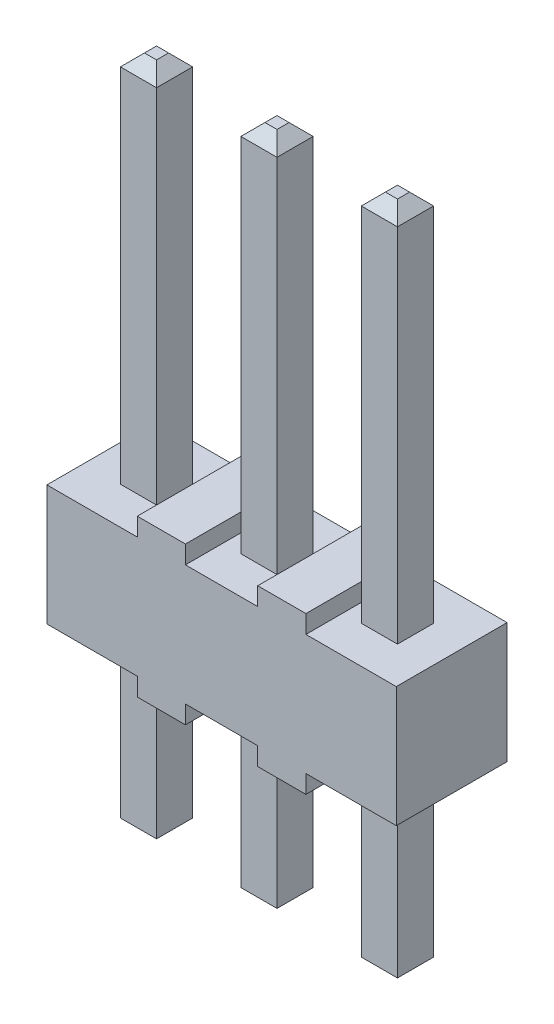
ISO-10303-21;
HEADER;
FILE_DESCRIPTION(('STEP AP214'),'2;1');
FILE_NAME('part.step','',(''),(''),'','','');
FILE_SCHEMA(('AUTOMOTIVE_DESIGN { 1 0 10303 214 1 1 1 1 }'));
ENDSEC;
DATA;
#1=APPLICATION_CONTEXT('core data for automotive mechanical design processes');
#2=APPLICATION_PROTOCOL_DEFINITION('international standard','automotive_design',2000,#1);
#3=PRODUCT_CONTEXT('',#1,'mechanical');
#4=PRODUCT('Part','Part','',(#3));
#5=PRODUCT_RELATED_PRODUCT_CATEGORY('part','',(#4));
#6=PRODUCT_DEFINITION_FORMATION('','',#4);
#7=PRODUCT_DEFINITION_CONTEXT('part definition',#1,'design');
#8=PRODUCT_DEFINITION('design','',#6,#7);
#9=PRODUCT_DEFINITION_SHAPE('','',#8);
#10=(LENGTH_UNIT() NAMED_UNIT(*) SI_UNIT(.MILLI.,.METRE.));
#11=(NAMED_UNIT(*) PLANE_ANGLE_UNIT() SI_UNIT($,.RADIAN.));
#12=(NAMED_UNIT(*) SI_UNIT($,.STERADIAN.) SOLID_ANGLE_UNIT());
#13=UNCERTAINTY_MEASURE_WITH_UNIT(LENGTH_MEASURE(1.E-05),#10,'distance_accuracy_value','');
#14=(GEOMETRIC_REPRESENTATION_CONTEXT(3) GLOBAL_UNCERTAINTY_ASSIGNED_CONTEXT((#13)) GLOBAL_UNIT_ASSIGNED_CONTEXT((#10,
#11,#12)) REPRESENTATION_CONTEXT('',''));
#15=CARTESIAN_POINT('',(0.,0.,0.));
#16=DIRECTION('',(0.,0.,1.));
#17=DIRECTION('',(1.,0.,0.));
#18=AXIS2_PLACEMENT_3D('',#15,#16,#17);
#19=CARTESIAN_POINT('',(-0.381,8.89,0.381));
#20=DIRECTION('',(0.,0.707106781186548,0.707106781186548));
#21=DIRECTION('',(0.,-0.707106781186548,0.707106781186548));
#22=AXIS2_PLACEMENT_3D('',#19,#20,#21);
#23=PLANE('',#22);
#24=DIRECTION('',(1.,0.,0.));
#25=VECTOR('',#24,1.);
#26=CARTESIAN_POINT('',(-0.381,9.144,0.127));
#27=LINE('',#26,#25);
#28=CARTESIAN_POINT('',(0.127,9.144,0.127));
#29=VERTEX_POINT('',#28);
#30=CARTESIAN_POINT('',(-0.127,9.144,0.127));
#31=VERTEX_POINT('',#30);
#32=EDGE_CURVE('E21',#29,#31,#27,.F.);
#33=ORIENTED_EDGE('',*,*,#32,.T.);
#34=DIRECTION('',(-0.577350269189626,-0.577350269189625,0.577350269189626));
#35=VECTOR('',#34,1.);
#36=CARTESIAN_POINT('',(-0.126999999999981,9.14400000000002,0.126999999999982));
#37=LINE('',#36,#35);
#38=CARTESIAN_POINT('',(-0.381,8.89,0.381));
#39=VERTEX_POINT('',#38);
#40=EDGE_CURVE('E389',#31,#39,#37,.T.);
#41=ORIENTED_EDGE('',*,*,#40,.T.);
#42=DIRECTION('',(1.,0.,0.));
#43=VECTOR('',#42,1.);
#44=CARTESIAN_POINT('',(-0.381,8.89,0.381));
#45=LINE('',#44,#43);
#46=CARTESIAN_POINT('',(0.381,8.89,0.381));
#47=VERTEX_POINT('',#46);
#48=EDGE_CURVE('E372',#39,#47,#45,.T.);
#49=ORIENTED_EDGE('',*,*,#48,.T.);
#50=DIRECTION('',(-0.577350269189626,0.577350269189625,-0.577350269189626));
#51=VECTOR('',#50,1.);
#52=CARTESIAN_POINT('',(0.381,8.89,0.381));
#53=LINE('',#52,#51);
#54=EDGE_CURVE('E370',#47,#29,#53,.T.);
#55=ORIENTED_EDGE('',*,*,#54,.T.);
#56=EDGE_LOOP('',(#33,#41,#49,#55));
#57=FACE_BOUND('',#56,.T.);
#58=ADVANCED_FACE('F18',(#57),#23,.T.);
#59=CARTESIAN_POINT('',(-0.381,-4.826,-0.381));
#60=DIRECTION('',(0.,-0.707106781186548,-0.707106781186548));
#61=DIRECTION('',(0.,0.707106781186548,-0.707106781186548));
#62=AXIS2_PLACEMENT_3D('',#59,#60,#61);
#63=PLANE('',#62);
#64=DIRECTION('',(1.,0.,0.));
#65=VECTOR('',#64,1.);
#66=CARTESIAN_POINT('',(-0.381,-5.08,-0.127));
#67=LINE('',#66,#65);
#68=CARTESIAN_POINT('',(0.127,-5.08,-0.127));
#69=VERTEX_POINT('',#68);
#70=CARTESIAN_POINT('',(-0.127,-5.08,-0.127));
#71=VERTEX_POINT('',#70);
#72=EDGE_CURVE('E396',#69,#71,#67,.F.);
#73=ORIENTED_EDGE('',*,*,#72,.T.);
#74=DIRECTION('',(-0.577350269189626,0.577350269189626,-0.577350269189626));
#75=VECTOR('',#74,1.);
#76=CARTESIAN_POINT('',(-0.126999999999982,-5.08000000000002,-0.126999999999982));
#77=LINE('',#76,#75);
#78=CARTESIAN_POINT('',(-0.381,-4.826,-0.381));
#79=VERTEX_POINT('',#78);
#80=EDGE_CURVE('E405',#71,#79,#77,.T.);
#81=ORIENTED_EDGE('',*,*,#80,.T.);
#82=DIRECTION('',(-1.,0.,0.));
#83=VECTOR('',#82,1.);
#84=CARTESIAN_POINT('',(-0.381,-4.826,-0.381));
#85=LINE('',#84,#83);
#86=CARTESIAN_POINT('',(0.381,-4.826,-0.381));
#87=VERTEX_POINT('',#86);
#88=EDGE_CURVE('E409',#79,#87,#85,.F.);
#89=ORIENTED_EDGE('',*,*,#88,.T.);
#90=DIRECTION('',(-0.577350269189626,-0.577350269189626,0.577350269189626));
#91=VECTOR('',#90,1.);
#92=CARTESIAN_POINT('',(0.381,-4.826,-0.381));
#93=LINE('',#92,#91);
#94=EDGE_CURVE('E398',#87,#69,#93,.T.);
#95=ORIENTED_EDGE('',*,*,#94,.T.);
#96=EDGE_LOOP('',(#73,#81,#89,#95));
#97=FACE_BOUND('',#96,.T.);
#98=ADVANCED_FACE('F1145',(#97),#63,.T.);
#99=CARTESIAN_POINT('',(-0.381,9.144,-0.381));
#100=DIRECTION('',(0.,1.,0.));
#101=DIRECTION('',(0.,0.,1.));
#102=AXIS2_PLACEMENT_3D('',#99,#100,#101);
#103=PLANE('',#102);
#104=DIRECTION('',(0.,0.,1.));
#105=VECTOR('',#104,1.);
#106=CARTESIAN_POINT('',(0.126999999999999,9.144,-0.381));
#107=LINE('',#106,#105);
#108=CARTESIAN_POINT('',(0.127,9.144,-0.127));
#109=VERTEX_POINT('',#108);
#110=EDGE_CURVE('E377',#29,#109,#107,.F.);
#111=ORIENTED_EDGE('',*,*,#110,.T.);
#112=DIRECTION('',(1.,0.,0.));
#113=VECTOR('',#112,1.);
#114=CARTESIAN_POINT('',(-0.381,9.144,-0.127));
#115=LINE('',#114,#113);
#116=CARTESIAN_POINT('',(-0.127,9.144,-0.127));
#117=VERTEX_POINT('',#116);
#118=EDGE_CURVE('E417',#109,#117,#115,.F.);
#119=ORIENTED_EDGE('',*,*,#118,.T.);
#120=DIRECTION('',(0.,0.,1.));
#121=VECTOR('',#120,1.);
#122=CARTESIAN_POINT('',(-0.126999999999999,9.144,-0.381));
#123=LINE('',#122,#121);
#124=EDGE_CURVE('E382',#117,#31,#123,.T.);
#125=ORIENTED_EDGE('',*,*,#124,.T.);
#126=ORIENTED_EDGE('',*,*,#32,.F.);
#127=EDGE_LOOP('',(#111,#119,#125,#126));
#128=FACE_BOUND('',#127,.T.);
#129=ADVANCED_FACE('F379',(#128),#103,.T.);
#130=CARTESIAN_POINT('',(0.381,8.89,-0.381));
#131=DIRECTION('',(-0.707106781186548,-0.707106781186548,0.));
#132=DIRECTION('',(0.707106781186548,-0.707106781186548,0.));
#133=AXIS2_PLACEMENT_3D('',#130,#131,#132);
#134=PLANE('',#133);
#135=ORIENTED_EDGE('',*,*,#110,.F.);
#136=ORIENTED_EDGE('',*,*,#54,.F.);
#137=DIRECTION('',(0.,0.,-1.));
#138=VECTOR('',#137,1.);
#139=CARTESIAN_POINT('',(0.381,8.89,0.));
#140=LINE('',#139,#138);
#141=CARTESIAN_POINT('',(0.381,8.89,-0.381));
#142=VERTEX_POINT('',#141);
#143=EDGE_CURVE('E415',#47,#142,#140,.T.);
#144=ORIENTED_EDGE('',*,*,#143,.T.);
#145=DIRECTION('',(-0.577350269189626,0.577350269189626,0.577350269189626));
#146=VECTOR('',#145,1.);
#147=CARTESIAN_POINT('',(0.381000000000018,8.88999999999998,-0.381000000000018));
#148=LINE('',#147,#146);
#149=EDGE_CURVE('E386',#142,#109,#148,.T.);
#150=ORIENTED_EDGE('',*,*,#149,.T.);
#151=EDGE_LOOP('',(#135,#136,#144,#150));
#152=FACE_BOUND('',#151,.T.);
#153=ADVANCED_FACE('F384',(#152),#134,.F.);
#154=CARTESIAN_POINT('',(-0.381,8.89,-0.381));
#155=DIRECTION('',(-0.707106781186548,0.707106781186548,0.));
#156=DIRECTION('',(-0.707106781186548,-0.707106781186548,0.));
#157=AXIS2_PLACEMENT_3D('',#154,#155,#156);
#158=PLANE('',#157);
#159=ORIENTED_EDGE('',*,*,#124,.F.);
#160=DIRECTION('',(-0.577350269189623,-0.577350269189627,-0.577350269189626));
#161=VECTOR('',#160,1.);
#162=CARTESIAN_POINT('',(-0.126999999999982,9.14400000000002,-0.126999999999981));
#163=LINE('',#162,#161);
#164=CARTESIAN_POINT('',(-0.381,8.89,-0.381));
#165=VERTEX_POINT('',#164);
#166=EDGE_CURVE('E419',#117,#165,#163,.T.);
#167=ORIENTED_EDGE('',*,*,#166,.T.);
#168=DIRECTION('',(0.,0.,-1.));
#169=VECTOR('',#168,1.);
#170=CARTESIAN_POINT('',(-0.381,8.89,0.));
#171=LINE('',#170,#169);
#172=EDGE_CURVE('E424',#165,#39,#171,.F.);
#173=ORIENTED_EDGE('',*,*,#172,.T.);
#174=ORIENTED_EDGE('',*,*,#40,.F.);
#175=EDGE_LOOP('',(#159,#167,#173,#174));
#176=FACE_BOUND('',#175,.T.);
#177=ADVANCED_FACE('F1137',(#176),#158,.T.);
#178=CARTESIAN_POINT('',(-0.381,9.144,0.381));
#179=DIRECTION('',(0.,0.,1.));
#180=DIRECTION('',(1.,0.,0.));
#181=AXIS2_PLACEMENT_3D('',#178,#179,#180);
#182=PLANE('',#181);
#183=ORIENTED_EDGE('',*,*,#48,.F.);
#184=DIRECTION('',(0.,1.,0.));
#185=VECTOR('',#184,1.);
#186=CARTESIAN_POINT('',(-0.381,0.,0.381));
#187=LINE('',#186,#185);
#188=CARTESIAN_POINT('',(-0.381,1.27,0.381));
#189=VERTEX_POINT('',#188);
#190=EDGE_CURVE('E427',#39,#189,#187,.F.);
#191=ORIENTED_EDGE('',*,*,#190,.T.);
#192=DIRECTION('',(1.,0.,0.));
#193=VECTOR('',#192,1.);
#194=CARTESIAN_POINT('',(-0.381,1.27,0.381));
#195=LINE('',#194,#193);
#196=CARTESIAN_POINT('',(0.381,1.27,0.381));
#197=VERTEX_POINT('',#196);
#198=EDGE_CURVE('E393',#197,#189,#195,.F.);
#199=ORIENTED_EDGE('',*,*,#198,.F.);
#200=DIRECTION('',(0.,1.,0.));
#201=VECTOR('',#200,1.);
#202=CARTESIAN_POINT('',(0.381,0.,0.381));
#203=LINE('',#202,#201);
#204=EDGE_CURVE('E413',#197,#47,#203,.T.);
#205=ORIENTED_EDGE('',*,*,#204,.T.);
#206=EDGE_LOOP('',(#183,#191,#199,#205));
#207=FACE_BOUND('',#206,.T.);
#208=ADVANCED_FACE('F1133',(#207),#182,.T.);
#209=CARTESIAN_POINT('',(-0.381,-5.08,0.381));
#210=DIRECTION('',(0.,-1.,0.));
#211=DIRECTION('',(0.,0.,-1.));
#212=AXIS2_PLACEMENT_3D('',#209,#210,#211);
#213=PLANE('',#212);
#214=DIRECTION('',(0.,0.,1.));
#215=VECTOR('',#214,1.);
#216=CARTESIAN_POINT('',(0.126999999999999,-5.08,0.381));
#217=LINE('',#216,#215);
#218=CARTESIAN_POINT('',(0.127,-5.08,0.127));
#219=VERTEX_POINT('',#218);
#220=EDGE_CURVE('E400',#69,#219,#217,.T.);
#221=ORIENTED_EDGE('',*,*,#220,.T.);
#222=DIRECTION('',(1.,0.,0.));
#223=VECTOR('',#222,1.);
#224=CARTESIAN_POINT('',(-0.381,-5.08,0.127));
#225=LINE('',#224,#223);
#226=CARTESIAN_POINT('',(-0.127,-5.08,0.127));
#227=VERTEX_POINT('',#226);
#228=EDGE_CURVE('E437',#219,#227,#225,.F.);
#229=ORIENTED_EDGE('',*,*,#228,.T.);
#230=DIRECTION('',(0.,0.,1.));
#231=VECTOR('',#230,1.);
#232=CARTESIAN_POINT('',(-0.126999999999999,-5.08,0.381));
#233=LINE('',#232,#231);
#234=EDGE_CURVE('E402',#227,#71,#233,.F.);
#235=ORIENTED_EDGE('',*,*,#234,.T.);
#236=ORIENTED_EDGE('',*,*,#72,.F.);
#237=EDGE_LOOP('',(#221,#229,#235,#236));
#238=FACE_BOUND('',#237,.T.);
#239=ADVANCED_FACE('F1129',(#238),#213,.T.);
#240=CARTESIAN_POINT('',(0.381,-4.826,0.381));
#241=DIRECTION('',(-0.707106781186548,0.707106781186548,0.));
#242=DIRECTION('',(-0.707106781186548,-0.707106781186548,0.));
#243=AXIS2_PLACEMENT_3D('',#240,#241,#242);
#244=PLANE('',#243);
#245=ORIENTED_EDGE('',*,*,#220,.F.);
#246=ORIENTED_EDGE('',*,*,#94,.F.);
#247=DIRECTION('',(0.,0.,-1.));
#248=VECTOR('',#247,1.);
#249=CARTESIAN_POINT('',(0.381,-4.826,0.));
#250=LINE('',#249,#248);
#251=CARTESIAN_POINT('',(0.381,-4.826,0.381));
#252=VERTEX_POINT('',#251);
#253=EDGE_CURVE('E435',#87,#252,#250,.F.);
#254=ORIENTED_EDGE('',*,*,#253,.T.);
#255=DIRECTION('',(-0.577350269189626,-0.577350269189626,-0.577350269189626));
#256=VECTOR('',#255,1.);
#257=CARTESIAN_POINT('',(0.381000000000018,-4.82599999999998,0.381000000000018));
#258=LINE('',#257,#256);
#259=EDGE_CURVE('E441',#252,#219,#258,.T.);
#260=ORIENTED_EDGE('',*,*,#259,.T.);
#261=EDGE_LOOP('',(#245,#246,#254,#260));
#262=FACE_BOUND('',#261,.T.);
#263=ADVANCED_FACE('F1125',(#262),#244,.F.);
#264=CARTESIAN_POINT('',(-0.381,-4.826,0.381));
#265=DIRECTION('',(-0.707106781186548,-0.707106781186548,0.));
#266=DIRECTION('',(0.707106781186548,-0.707106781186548,0.));
#267=AXIS2_PLACEMENT_3D('',#264,#265,#266);
#268=PLANE('',#267);
#269=ORIENTED_EDGE('',*,*,#234,.F.);
#270=DIRECTION('',(-0.577350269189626,0.577350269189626,0.577350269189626));
#271=VECTOR('',#270,1.);
#272=CARTESIAN_POINT('',(-0.126999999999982,-5.08000000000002,0.126999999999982));
#273=LINE('',#272,#271);
#274=CARTESIAN_POINT('',(-0.381,-4.826,0.381));
#275=VERTEX_POINT('',#274);
#276=EDGE_CURVE('E439',#227,#275,#273,.T.);
#277=ORIENTED_EDGE('',*,*,#276,.T.);
#278=DIRECTION('',(0.,0.,-1.));
#279=VECTOR('',#278,1.);
#280=CARTESIAN_POINT('',(-0.381,-4.826,0.));
#281=LINE('',#280,#279);
#282=EDGE_CURVE('E446',#275,#79,#281,.T.);
#283=ORIENTED_EDGE('',*,*,#282,.T.);
#284=ORIENTED_EDGE('',*,*,#80,.F.);
#285=EDGE_LOOP('',(#269,#277,#283,#284));
#286=FACE_BOUND('',#285,.T.);
#287=ADVANCED_FACE('F1121',(#286),#268,.T.);
#288=CARTESIAN_POINT('',(-0.381,-5.08,-0.381));
#289=DIRECTION('',(0.,0.,-1.));
#290=DIRECTION('',(-1.,0.,0.));
#291=AXIS2_PLACEMENT_3D('',#288,#289,#290);
#292=PLANE('',#291);
#293=ORIENTED_EDGE('',*,*,#88,.F.);
#294=DIRECTION('',(0.,1.,0.));
#295=VECTOR('',#294,1.);
#296=CARTESIAN_POINT('',(-0.381,0.,-0.381));
#297=LINE('',#296,#295);
#298=CARTESIAN_POINT('',(-0.381,-1.27,-0.381));
#299=VERTEX_POINT('',#298);
#300=EDGE_CURVE('E449',#79,#299,#297,.T.);
#301=ORIENTED_EDGE('',*,*,#300,.T.);
#302=DIRECTION('',(-1.,0.,0.));
#303=VECTOR('',#302,1.);
#304=CARTESIAN_POINT('',(-0.381,-1.27,-0.381));
#305=LINE('',#304,#303);
#306=CARTESIAN_POINT('',(0.381,-1.27,-0.381));
#307=VERTEX_POINT('',#306);
#308=EDGE_CURVE('E407',#307,#299,#305,.T.);
#309=ORIENTED_EDGE('',*,*,#308,.F.);
#310=DIRECTION('',(0.,1.,0.));
#311=VECTOR('',#310,1.);
#312=CARTESIAN_POINT('',(0.381,0.,-0.381));
#313=LINE('',#312,#311);
#314=EDGE_CURVE('E432',#307,#87,#313,.F.);
#315=ORIENTED_EDGE('',*,*,#314,.T.);
#316=EDGE_LOOP('',(#293,#301,#309,#315));
#317=FACE_BOUND('',#316,.T.);
#318=ADVANCED_FACE('F1117',(#317),#292,.T.);
#319=CARTESIAN_POINT('',(0.381,0.,0.));
#320=DIRECTION('',(1.,0.,0.));
#321=DIRECTION('',(0.,0.,-1.));
#322=AXIS2_PLACEMENT_3D('',#319,#320,#321);
#323=PLANE('',#322);
#324=ORIENTED_EDGE('',*,*,#143,.F.);
#325=ORIENTED_EDGE('',*,*,#204,.F.);
#326=DIRECTION('',(0.,0.,-1.));
#327=VECTOR('',#326,1.);
#328=CARTESIAN_POINT('',(0.381,1.27,0.));
#329=LINE('',#328,#327);
#330=CARTESIAN_POINT('',(0.381,1.27,-0.381));
#331=VERTEX_POINT('',#330);
#332=EDGE_CURVE('E411',#331,#197,#329,.F.);
#333=ORIENTED_EDGE('',*,*,#332,.F.);
#334=DIRECTION('',(0.,1.,0.));
#335=VECTOR('',#334,1.);
#336=CARTESIAN_POINT('',(0.381,1.27,-0.381));
#337=LINE('',#336,#335);
#338=EDGE_CURVE('E452',#331,#142,#337,.T.);
#339=ORIENTED_EDGE('',*,*,#338,.T.);
#340=EDGE_LOOP('',(#324,#325,#333,#339));
#341=FACE_BOUND('',#340,.T.);
#342=ADVANCED_FACE('F1113',(#341),#323,.T.);
#343=CARTESIAN_POINT('',(-0.381,9.144,-0.127));
#344=DIRECTION('',(0.,0.707106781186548,-0.707106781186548));
#345=DIRECTION('',(0.,0.707106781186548,0.707106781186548));
#346=AXIS2_PLACEMENT_3D('',#343,#344,#345);
#347=PLANE('',#346);
#348=DIRECTION('',(-1.,0.,0.));
#349=VECTOR('',#348,1.);
#350=CARTESIAN_POINT('',(-0.381,8.89,-0.381));
#351=LINE('',#350,#349);
#352=EDGE_CURVE('E455',#142,#165,#351,.T.);
#353=ORIENTED_EDGE('',*,*,#352,.T.);
#354=ORIENTED_EDGE('',*,*,#166,.F.);
#355=ORIENTED_EDGE('',*,*,#118,.F.);
#356=ORIENTED_EDGE('',*,*,#149,.F.);
#357=EDGE_LOOP('',(#353,#354,#355,#356));
#358=FACE_BOUND('',#357,.T.);
#359=ADVANCED_FACE('F1109',(#358),#347,.T.);
#360=CARTESIAN_POINT('',(-0.381,0.,0.));
#361=DIRECTION('',(1.,0.,0.));
#362=DIRECTION('',(0.,0.,-1.));
#363=AXIS2_PLACEMENT_3D('',#360,#361,#362);
#364=PLANE('',#363);
#365=ORIENTED_EDGE('',*,*,#172,.F.);
#366=DIRECTION('',(0.,1.,0.));
#367=VECTOR('',#366,1.);
#368=CARTESIAN_POINT('',(-0.381,1.27,-0.381));
#369=LINE('',#368,#367);
#370=CARTESIAN_POINT('',(-0.381,1.27,-0.381));
#371=VERTEX_POINT('',#370);
#372=EDGE_CURVE('E458',#165,#371,#369,.F.);
#373=ORIENTED_EDGE('',*,*,#372,.T.);
#374=DIRECTION('',(0.,0.,-1.));
#375=VECTOR('',#374,1.);
#376=CARTESIAN_POINT('',(-0.381,1.27,0.));
#377=LINE('',#376,#375);
#378=EDGE_CURVE('E422',#189,#371,#377,.T.);
#379=ORIENTED_EDGE('',*,*,#378,.F.);
#380=ORIENTED_EDGE('',*,*,#190,.F.);
#381=EDGE_LOOP('',(#365,#373,#379,#380));
#382=FACE_BOUND('',#381,.T.);
#383=ADVANCED_FACE('F1105',(#382),#364,.F.);
#384=CARTESIAN_POINT('',(0.381,0.,0.));
#385=DIRECTION('',(1.,0.,0.));
#386=DIRECTION('',(0.,0.,-1.));
#387=AXIS2_PLACEMENT_3D('',#384,#385,#386);
#388=PLANE('',#387);
#389=ORIENTED_EDGE('',*,*,#253,.F.);
#390=ORIENTED_EDGE('',*,*,#314,.F.);
#391=DIRECTION('',(0.,0.,-1.));
#392=VECTOR('',#391,1.);
#393=CARTESIAN_POINT('',(0.381,-1.27,0.));
#394=LINE('',#393,#392);
#395=CARTESIAN_POINT('',(0.381,-1.27,0.381));
#396=VERTEX_POINT('',#395);
#397=EDGE_CURVE('E430',#396,#307,#394,.T.);
#398=ORIENTED_EDGE('',*,*,#397,.F.);
#399=DIRECTION('',(0.,1.,0.));
#400=VECTOR('',#399,1.);
#401=CARTESIAN_POINT('',(0.381,-1.27,0.381));
#402=LINE('',#401,#400);
#403=EDGE_CURVE('E461',#396,#252,#402,.F.);
#404=ORIENTED_EDGE('',*,*,#403,.T.);
#405=EDGE_LOOP('',(#389,#390,#398,#404));
#406=FACE_BOUND('',#405,.T.);
#407=ADVANCED_FACE('F1101',(#406),#388,.T.);
#408=CARTESIAN_POINT('',(-0.381,-5.08,0.127));
#409=DIRECTION('',(0.,-0.707106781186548,0.707106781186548));
#410=DIRECTION('',(0.,-0.707106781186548,-0.707106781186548));
#411=AXIS2_PLACEMENT_3D('',#408,#409,#410);
#412=PLANE('',#411);
#413=DIRECTION('',(1.,0.,0.));
#414=VECTOR('',#413,1.);
#415=CARTESIAN_POINT('',(-0.381,-4.826,0.381));
#416=LINE('',#415,#414);
#417=EDGE_CURVE('E464',#252,#275,#416,.F.);
#418=ORIENTED_EDGE('',*,*,#417,.T.);
#419=ORIENTED_EDGE('',*,*,#276,.F.);
#420=ORIENTED_EDGE('',*,*,#228,.F.);
#421=ORIENTED_EDGE('',*,*,#259,.F.);
#422=EDGE_LOOP('',(#418,#419,#420,#421));
#423=FACE_BOUND('',#422,.T.);
#424=ADVANCED_FACE('F1097',(#423),#412,.T.);
#425=CARTESIAN_POINT('',(-0.381,0.,0.));
#426=DIRECTION('',(1.,0.,0.));
#427=DIRECTION('',(0.,0.,-1.));
#428=AXIS2_PLACEMENT_3D('',#425,#426,#427);
#429=PLANE('',#428);
#430=ORIENTED_EDGE('',*,*,#282,.F.);
#431=DIRECTION('',(0.,1.,0.));
#432=VECTOR('',#431,1.);
#433=CARTESIAN_POINT('',(-0.381,-1.27,0.381));
#434=LINE('',#433,#432);
#435=CARTESIAN_POINT('',(-0.381,-1.27,0.381));
#436=VERTEX_POINT('',#435);
#437=EDGE_CURVE('E467',#275,#436,#434,.T.);
#438=ORIENTED_EDGE('',*,*,#437,.T.);
#439=DIRECTION('',(0.,0.,-1.));
#440=VECTOR('',#439,1.);
#441=CARTESIAN_POINT('',(-0.381,-1.27,0.));
#442=LINE('',#441,#440);
#443=EDGE_CURVE('E444',#299,#436,#442,.F.);
#444=ORIENTED_EDGE('',*,*,#443,.F.);
#445=ORIENTED_EDGE('',*,*,#300,.F.);
#446=EDGE_LOOP('',(#430,#438,#444,#445));
#447=FACE_BOUND('',#446,.T.);
#448=ADVANCED_FACE('F1093',(#447),#429,.F.);
#449=CARTESIAN_POINT('',(-0.381,1.27,-0.381));
#450=DIRECTION('',(0.,0.,-1.));
#451=DIRECTION('',(-1.,0.,0.));
#452=AXIS2_PLACEMENT_3D('',#449,#450,#451);
#453=PLANE('',#452);
#454=ORIENTED_EDGE('',*,*,#352,.F.);
#455=ORIENTED_EDGE('',*,*,#338,.F.);
#456=DIRECTION('',(1.,0.,0.));
#457=VECTOR('',#456,1.);
#458=CARTESIAN_POINT('',(-0.762,1.27,-0.381));
#459=LINE('',#458,#457);
#460=EDGE_CURVE('E474',#331,#371,#459,.F.);
#461=ORIENTED_EDGE('',*,*,#460,.T.);
#462=ORIENTED_EDGE('',*,*,#372,.F.);
#463=EDGE_LOOP('',(#454,#455,#461,#462));
#464=FACE_BOUND('',#463,.T.);
#465=ADVANCED_FACE('F1089',(#464),#453,.T.);
#466=CARTESIAN_POINT('',(-0.381,-1.27,0.381));
#467=DIRECTION('',(0.,0.,1.));
#468=DIRECTION('',(1.,0.,0.));
#469=AXIS2_PLACEMENT_3D('',#466,#467,#468);
#470=PLANE('',#469);
#471=ORIENTED_EDGE('',*,*,#417,.F.);
#472=ORIENTED_EDGE('',*,*,#403,.F.);
#473=DIRECTION('',(1.,0.,0.));
#474=VECTOR('',#473,1.);
#475=CARTESIAN_POINT('',(0.762,-1.27,0.381));
#476=LINE('',#475,#474);
#477=EDGE_CURVE('E481',#396,#436,#476,.F.);
#478=ORIENTED_EDGE('',*,*,#477,.T.);
#479=ORIENTED_EDGE('',*,*,#437,.F.);
#480=EDGE_LOOP('',(#471,#472,#478,#479));
#481=FACE_BOUND('',#480,.T.);
#482=ADVANCED_FACE('F1085',(#481),#470,.T.);
#483=CARTESIAN_POINT('',(2.159,8.89,0.381));
#484=DIRECTION('',(0.,0.707106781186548,0.707106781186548));
#485=DIRECTION('',(0.,-0.707106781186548,0.707106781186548));
#486=AXIS2_PLACEMENT_3D('',#483,#484,#485);
#487=PLANE('',#486);
#488=DIRECTION('',(1.,0.,0.));
#489=VECTOR('',#488,1.);
#490=CARTESIAN_POINT('',(2.159,9.144,0.127));
#491=LINE('',#490,#489);
#492=CARTESIAN_POINT('',(2.667,9.144,0.127));
#493=VERTEX_POINT('',#492);
#494=CARTESIAN_POINT('',(2.413,9.144,0.127));
#495=VERTEX_POINT('',#494);
#496=EDGE_CURVE('E491',#493,#495,#491,.F.);
#497=ORIENTED_EDGE('',*,*,#496,.T.);
#498=DIRECTION('',(-0.577350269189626,-0.577350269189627,0.577350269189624));
#499=VECTOR('',#498,1.);
#500=CARTESIAN_POINT('',(2.41300000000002,9.14400000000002,0.126999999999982));
#501=LINE('',#500,#499);
#502=CARTESIAN_POINT('',(2.159,8.89,0.381));
#503=VERTEX_POINT('',#502);
#504=EDGE_CURVE('E500',#495,#503,#501,.T.);
#505=ORIENTED_EDGE('',*,*,#504,.T.);
#506=DIRECTION('',(1.,0.,0.));
#507=VECTOR('',#506,1.);
#508=CARTESIAN_POINT('',(2.159,8.89,0.381));
#509=LINE('',#508,#507);
#510=CARTESIAN_POINT('',(2.921,8.89,0.381));
#511=VERTEX_POINT('',#510);
#512=EDGE_CURVE('E504',#503,#511,#509,.T.);
#513=ORIENTED_EDGE('',*,*,#512,.T.);
#514=DIRECTION('',(-0.577350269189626,0.577350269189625,-0.577350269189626));
#515=VECTOR('',#514,1.);
#516=CARTESIAN_POINT('',(2.921,8.89,0.381));
#517=LINE('',#516,#515);
#518=EDGE_CURVE('E493',#511,#493,#517,.T.);
#519=ORIENTED_EDGE('',*,*,#518,.T.);
#520=EDGE_LOOP('',(#497,#505,#513,#519));
#521=FACE_BOUND('',#520,.T.);
#522=ADVANCED_FACE('F1081',(#521),#487,.T.);
#523=CARTESIAN_POINT('',(-0.762,1.27,1.1684));
#524=DIRECTION('',(0.,-1.,0.));
#525=DIRECTION('',(0.,0.,-1.));
#526=AXIS2_PLACEMENT_3D('',#523,#524,#525);
#527=PLANE('',#526);
#528=ORIENTED_EDGE('',*,*,#332,.T.);
#529=ORIENTED_EDGE('',*,*,#198,.T.);
#530=ORIENTED_EDGE('',*,*,#378,.T.);
#531=ORIENTED_EDGE('',*,*,#460,.F.);
#532=EDGE_LOOP('',(#528,#529,#530,#531));
#533=FACE_BOUND('',#532,.T.);
#534=DIRECTION('',(1.,0.,0.));
#535=VECTOR('',#534,1.);
#536=CARTESIAN_POINT('',(-0.762,1.27,-1.1684));
#537=LINE('',#536,#535);
#538=CARTESIAN_POINT('',(-0.762,1.27,-1.1684));
#539=VERTEX_POINT('',#538);
#540=CARTESIAN_POINT('',(0.762,1.27,-1.1684));
#541=VERTEX_POINT('',#540);
#542=EDGE_CURVE('E472',#539,#541,#537,.T.);
#543=ORIENTED_EDGE('',*,*,#542,.F.);
#544=DIRECTION('',(0.,0.,1.));
#545=VECTOR('',#544,1.);
#546=CARTESIAN_POINT('',(-0.762,1.27,1.1684));
#547=LINE('',#546,#545);
#548=CARTESIAN_POINT('',(-0.762,1.27,1.1684));
#549=VERTEX_POINT('',#548);
#550=EDGE_CURVE('E510',#539,#549,#547,.T.);
#551=ORIENTED_EDGE('',*,*,#550,.T.);
#552=DIRECTION('',(1.,0.,0.));
#553=VECTOR('',#552,1.);
#554=CARTESIAN_POINT('',(-0.762,1.27,1.1684));
#555=LINE('',#554,#553);
#556=CARTESIAN_POINT('',(0.762,1.27,1.1684));
#557=VERTEX_POINT('',#556);
#558=EDGE_CURVE('E470',#557,#549,#555,.F.);
#559=ORIENTED_EDGE('',*,*,#558,.F.);
#560=DIRECTION('',(0.,0.,-1.));
#561=VECTOR('',#560,1.);
#562=CARTESIAN_POINT('',(0.762,1.27,1.1684));
#563=LINE('',#562,#561);
#564=EDGE_CURVE('E486',#557,#541,#563,.T.);
#565=ORIENTED_EDGE('',*,*,#564,.T.);
#566=EDGE_LOOP('',(#543,#551,#559,#565));
#567=FACE_BOUND('',#566,.T.);
#568=ADVANCED_FACE('F857',(#533,#567),#527,.F.);
#569=CARTESIAN_POINT('',(-2.921,8.89,0.381));
#570=DIRECTION('',(0.,0.707106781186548,0.707106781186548));
#571=DIRECTION('',(0.,-0.707106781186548,0.707106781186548));
#572=AXIS2_PLACEMENT_3D('',#569,#570,#571);
#573=PLANE('',#572);
#574=DIRECTION('',(1.,0.,0.));
#575=VECTOR('',#574,1.);
#576=CARTESIAN_POINT('',(-2.921,9.144,0.127));
#577=LINE('',#576,#575);
#578=CARTESIAN_POINT('',(-2.413,9.144,0.127));
#579=VERTEX_POINT('',#578);
#580=CARTESIAN_POINT('',(-2.667,9.144,0.127));
#581=VERTEX_POINT('',#580);
#582=EDGE_CURVE('E513',#579,#581,#577,.F.);
#583=ORIENTED_EDGE('',*,*,#582,.T.);
#584=DIRECTION('',(-0.577350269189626,-0.577350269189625,0.577350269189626));
#585=VECTOR('',#584,1.);
#586=CARTESIAN_POINT('',(-2.66699999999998,9.14400000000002,0.126999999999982));
#587=LINE('',#586,#585);
#588=CARTESIAN_POINT('',(-2.921,8.89,0.381));
#589=VERTEX_POINT('',#588);
#590=EDGE_CURVE('E522',#581,#589,#587,.T.);
#591=ORIENTED_EDGE('',*,*,#590,.T.);
#592=DIRECTION('',(1.,0.,0.));
#593=VECTOR('',#592,1.);
#594=CARTESIAN_POINT('',(-2.921,8.89,0.381));
#595=LINE('',#594,#593);
#596=CARTESIAN_POINT('',(-2.159,8.89,0.381));
#597=VERTEX_POINT('',#596);
#598=EDGE_CURVE('E526',#589,#597,#595,.T.);
#599=ORIENTED_EDGE('',*,*,#598,.T.);
#600=DIRECTION('',(-0.577350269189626,0.577350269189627,-0.577350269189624));
#601=VECTOR('',#600,1.);
#602=CARTESIAN_POINT('',(-2.159,8.89,0.381));
#603=LINE('',#602,#601);
#604=EDGE_CURVE('E515',#597,#579,#603,.T.);
#605=ORIENTED_EDGE('',*,*,#604,.T.);
#606=EDGE_LOOP('',(#583,#591,#599,#605));
#607=FACE_BOUND('',#606,.T.);
#608=ADVANCED_FACE('F1075',(#607),#573,.T.);
#609=CARTESIAN_POINT('',(-2.921,-4.826,-0.381));
#610=DIRECTION('',(0.,-0.707106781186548,-0.707106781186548));
#611=DIRECTION('',(0.,0.707106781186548,-0.707106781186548));
#612=AXIS2_PLACEMENT_3D('',#609,#610,#611);
#613=PLANE('',#612);
#614=DIRECTION('',(1.,0.,0.));
#615=VECTOR('',#614,1.);
#616=CARTESIAN_POINT('',(-2.921,-5.08,-0.127));
#617=LINE('',#616,#615);
#618=CARTESIAN_POINT('',(-2.413,-5.08,-0.127));
#619=VERTEX_POINT('',#618);
#620=CARTESIAN_POINT('',(-2.667,-5.08,-0.127));
#621=VERTEX_POINT('',#620);
#622=EDGE_CURVE('E535',#619,#621,#617,.F.);
#623=ORIENTED_EDGE('',*,*,#622,.T.);
#624=DIRECTION('',(-0.577350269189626,0.577350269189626,-0.577350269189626));
#625=VECTOR('',#624,1.);
#626=CARTESIAN_POINT('',(-2.66699999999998,-5.08000000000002,-0.126999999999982));
#627=LINE('',#626,#625);
#628=CARTESIAN_POINT('',(-2.921,-4.826,-0.381));
#629=VERTEX_POINT('',#628);
#630=EDGE_CURVE('E544',#621,#629,#627,.T.);
#631=ORIENTED_EDGE('',*,*,#630,.T.);
#632=DIRECTION('',(-1.,0.,0.));
#633=VECTOR('',#632,1.);
#634=CARTESIAN_POINT('',(-2.921,-4.826,-0.381));
#635=LINE('',#634,#633);
#636=CARTESIAN_POINT('',(-2.159,-4.826,-0.381));
#637=VERTEX_POINT('',#636);
#638=EDGE_CURVE('E548',#629,#637,#635,.F.);
#639=ORIENTED_EDGE('',*,*,#638,.T.);
#640=DIRECTION('',(-0.577350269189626,-0.577350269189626,0.577350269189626));
#641=VECTOR('',#640,1.);
#642=CARTESIAN_POINT('',(-2.159,-4.826,-0.381));
#643=LINE('',#642,#641);
#644=EDGE_CURVE('E537',#637,#619,#643,.T.);
#645=ORIENTED_EDGE('',*,*,#644,.T.);
#646=EDGE_LOOP('',(#623,#631,#639,#645));
#647=FACE_BOUND('',#646,.T.);
#648=ADVANCED_FACE('F1008',(#647),#613,.T.);
#649=CARTESIAN_POINT('',(0.762,-1.27,1.1684));
#650=DIRECTION('',(0.,1.,0.));
#651=DIRECTION('',(0.,0.,1.));
#652=AXIS2_PLACEMENT_3D('',#649,#650,#651);
#653=PLANE('',#652);
#654=ORIENTED_EDGE('',*,*,#397,.T.);
#655=ORIENTED_EDGE('',*,*,#308,.T.);
#656=ORIENTED_EDGE('',*,*,#443,.T.);
#657=ORIENTED_EDGE('',*,*,#477,.F.);
#658=EDGE_LOOP('',(#654,#655,#656,#657));
#659=FACE_BOUND('',#658,.T.);
#660=DIRECTION('',(1.,0.,0.));
#661=VECTOR('',#660,1.);
#662=CARTESIAN_POINT('',(0.762,-1.27,-1.1684));
#663=LINE('',#662,#661);
#664=CARTESIAN_POINT('',(0.762,-1.27,-1.1684));
#665=VERTEX_POINT('',#664);
#666=CARTESIAN_POINT('',(-0.762,-1.27,-1.1684));
#667=VERTEX_POINT('',#666);
#668=EDGE_CURVE('E479',#665,#667,#663,.F.);
#669=ORIENTED_EDGE('',*,*,#668,.F.);
#670=DIRECTION('',(0.,0.,-1.));
#671=VECTOR('',#670,1.);
#672=CARTESIAN_POINT('',(0.762,-1.27,1.1684));
#673=LINE('',#672,#671);
#674=CARTESIAN_POINT('',(0.762,-1.27,1.1684));
#675=VERTEX_POINT('',#674);
#676=EDGE_CURVE('E554',#665,#675,#673,.F.);
#677=ORIENTED_EDGE('',*,*,#676,.T.);
#678=DIRECTION('',(1.,0.,0.));
#679=VECTOR('',#678,1.);
#680=CARTESIAN_POINT('',(0.762,-1.27,1.1684));
#681=LINE('',#680,#679);
#682=CARTESIAN_POINT('',(-0.762,-1.27,1.1684));
#683=VERTEX_POINT('',#682);
#684=EDGE_CURVE('E477',#683,#675,#681,.T.);
#685=ORIENTED_EDGE('',*,*,#684,.F.);
#686=DIRECTION('',(0.,0.,1.));
#687=VECTOR('',#686,1.);
#688=CARTESIAN_POINT('',(-0.762,-1.27,1.1684));
#689=LINE('',#688,#687);
#690=EDGE_CURVE('E530',#683,#667,#689,.F.);
#691=ORIENTED_EDGE('',*,*,#690,.T.);
#692=EDGE_LOOP('',(#669,#677,#685,#691));
#693=FACE_BOUND('',#692,.T.);
#694=ADVANCED_FACE('F896',(#659,#693),#653,.F.);
#695=CARTESIAN_POINT('',(2.159,-4.826,-0.381));
#696=DIRECTION('',(0.,-0.707106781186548,-0.707106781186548));
#697=DIRECTION('',(0.,0.707106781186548,-0.707106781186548));
#698=AXIS2_PLACEMENT_3D('',#695,#696,#697);
#699=PLANE('',#698);
#700=DIRECTION('',(1.,0.,0.));
#701=VECTOR('',#700,1.);
#702=CARTESIAN_POINT('',(2.159,-5.08,-0.127));
#703=LINE('',#702,#701);
#704=CARTESIAN_POINT('',(2.667,-5.08,-0.127));
#705=VERTEX_POINT('',#704);
#706=CARTESIAN_POINT('',(2.413,-5.08,-0.127));
#707=VERTEX_POINT('',#706);
#708=EDGE_CURVE('E557',#705,#707,#703,.F.);
#709=ORIENTED_EDGE('',*,*,#708,.T.);
#710=DIRECTION('',(-0.577350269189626,0.577350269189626,-0.577350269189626));
#711=VECTOR('',#710,1.);
#712=CARTESIAN_POINT('',(2.41300000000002,-5.08000000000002,-0.126999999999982));
#713=LINE('',#712,#711);
#714=CARTESIAN_POINT('',(2.159,-4.826,-0.381));
#715=VERTEX_POINT('',#714);
#716=EDGE_CURVE('E566',#707,#715,#713,.T.);
#717=ORIENTED_EDGE('',*,*,#716,.T.);
#718=DIRECTION('',(-1.,0.,0.));
#719=VECTOR('',#718,1.);
#720=CARTESIAN_POINT('',(2.159,-4.826,-0.381));
#721=LINE('',#720,#719);
#722=CARTESIAN_POINT('',(2.921,-4.826,-0.381));
#723=VERTEX_POINT('',#722);
#724=EDGE_CURVE('E570',#715,#723,#721,.F.);
#725=ORIENTED_EDGE('',*,*,#724,.T.);
#726=DIRECTION('',(-0.577350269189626,-0.577350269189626,0.577350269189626));
#727=VECTOR('',#726,1.);
#728=CARTESIAN_POINT('',(2.921,-4.826,-0.381));
#729=LINE('',#728,#727);
#730=EDGE_CURVE('E559',#723,#705,#729,.T.);
#731=ORIENTED_EDGE('',*,*,#730,.T.);
#732=EDGE_LOOP('',(#709,#717,#725,#731));
#733=FACE_BOUND('',#732,.T.);
#734=ADVANCED_FACE('F1066',(#733),#699,.T.);
#735=CARTESIAN_POINT('',(0.762,1.27,1.1684));
#736=DIRECTION('',(1.,0.,0.));
#737=DIRECTION('',(0.,0.,-1.));
#738=AXIS2_PLACEMENT_3D('',#735,#736,#737);
#739=PLANE('',#738);
#740=DIRECTION('',(0.,1.,0.));
#741=VECTOR('',#740,1.);
#742=CARTESIAN_POINT('',(0.762,1.27,-1.1684));
#743=LINE('',#742,#741);
#744=CARTESIAN_POINT('',(0.762,1.651,-1.1684));
#745=VERTEX_POINT('',#744);
#746=EDGE_CURVE('E489',#541,#745,#743,.T.);
#747=ORIENTED_EDGE('',*,*,#746,.F.);
#748=ORIENTED_EDGE('',*,*,#564,.F.);
#749=DIRECTION('',(0.,1.,0.));
#750=VECTOR('',#749,1.);
#751=CARTESIAN_POINT('',(0.762,1.27,1.1684));
#752=LINE('',#751,#750);
#753=CARTESIAN_POINT('',(0.762,1.651,1.1684));
#754=VERTEX_POINT('',#753);
#755=EDGE_CURVE('E484',#754,#557,#752,.F.);
#756=ORIENTED_EDGE('',*,*,#755,.F.);
#757=DIRECTION('',(0.,0.,1.));
#758=VECTOR('',#757,1.);
#759=CARTESIAN_POINT('',(0.762,1.651,-1.1684));
#760=LINE('',#759,#758);
#761=EDGE_CURVE('E572',#754,#745,#760,.F.);
#762=ORIENTED_EDGE('',*,*,#761,.T.);
#763=EDGE_LOOP('',(#747,#748,#756,#762));
#764=FACE_BOUND('',#763,.T.);
#765=ADVANCED_FACE('F861',(#764),#739,.F.);
#766=CARTESIAN_POINT('',(2.159,9.144,-0.381));
#767=DIRECTION('',(0.,1.,0.));
#768=DIRECTION('',(0.,0.,1.));
#769=AXIS2_PLACEMENT_3D('',#766,#767,#768);
#770=PLANE('',#769);
#771=DIRECTION('',(0.,0.,1.));
#772=VECTOR('',#771,1.);
#773=CARTESIAN_POINT('',(2.667,9.144,-0.381));
#774=LINE('',#773,#772);
#775=CARTESIAN_POINT('',(2.667,9.144,-0.127));
#776=VERTEX_POINT('',#775);
#777=EDGE_CURVE('E495',#493,#776,#774,.F.);
#778=ORIENTED_EDGE('',*,*,#777,.T.);
#779=DIRECTION('',(1.,0.,0.));
#780=VECTOR('',#779,1.);
#781=CARTESIAN_POINT('',(2.159,9.144,-0.127));
#782=LINE('',#781,#780);
#783=CARTESIAN_POINT('',(2.413,9.144,-0.127));
#784=VERTEX_POINT('',#783);
#785=EDGE_CURVE('E587',#776,#784,#782,.F.);
#786=ORIENTED_EDGE('',*,*,#785,.T.);
#787=DIRECTION('',(0.,0.,1.));
#788=VECTOR('',#787,1.);
#789=CARTESIAN_POINT('',(2.413,9.144,-0.381));
#790=LINE('',#789,#788);
#791=EDGE_CURVE('E497',#784,#495,#790,.T.);
#792=ORIENTED_EDGE('',*,*,#791,.T.);
#793=ORIENTED_EDGE('',*,*,#496,.F.);
#794=EDGE_LOOP('',(#778,#786,#792,#793));
#795=FACE_BOUND('',#794,.T.);
#796=ADVANCED_FACE('F1059',(#795),#770,.T.);
#797=CARTESIAN_POINT('',(2.921,8.89,-0.381));
#798=DIRECTION('',(-0.707106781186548,-0.707106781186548,0.));
#799=DIRECTION('',(0.707106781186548,-0.707106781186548,0.));
#800=AXIS2_PLACEMENT_3D('',#797,#798,#799);
#801=PLANE('',#800);
#802=ORIENTED_EDGE('',*,*,#777,.F.);
#803=ORIENTED_EDGE('',*,*,#518,.F.);
#804=DIRECTION('',(0.,0.,-1.));
#805=VECTOR('',#804,1.);
#806=CARTESIAN_POINT('',(2.921,8.89,0.));
#807=LINE('',#806,#805);
#808=CARTESIAN_POINT('',(2.921,8.89,-0.381));
#809=VERTEX_POINT('',#808);
#810=EDGE_CURVE('E585',#511,#809,#807,.T.);
#811=ORIENTED_EDGE('',*,*,#810,.T.);
#812=DIRECTION('',(-0.577350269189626,0.577350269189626,0.577350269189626));
#813=VECTOR('',#812,1.);
#814=CARTESIAN_POINT('',(2.92100000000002,8.88999999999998,-0.381000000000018));
#815=LINE('',#814,#813);
#816=EDGE_CURVE('E591',#809,#776,#815,.T.);
#817=ORIENTED_EDGE('',*,*,#816,.T.);
#818=EDGE_LOOP('',(#802,#803,#811,#817));
#819=FACE_BOUND('',#818,.T.);
#820=ADVANCED_FACE('F1055',(#819),#801,.F.);
#821=CARTESIAN_POINT('',(2.159,8.89,-0.381));
#822=DIRECTION('',(-0.707106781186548,0.707106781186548,0.));
#823=DIRECTION('',(-0.707106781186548,-0.707106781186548,0.));
#824=AXIS2_PLACEMENT_3D('',#821,#822,#823);
#825=PLANE('',#824);
#826=ORIENTED_EDGE('',*,*,#791,.F.);
#827=DIRECTION('',(-0.577350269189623,-0.577350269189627,-0.577350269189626));
#828=VECTOR('',#827,1.);
#829=CARTESIAN_POINT('',(2.41300000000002,9.14400000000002,-0.126999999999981));
#830=LINE('',#829,#828);
#831=CARTESIAN_POINT('',(2.159,8.89,-0.381));
#832=VERTEX_POINT('',#831);
#833=EDGE_CURVE('E589',#784,#832,#830,.T.);
#834=ORIENTED_EDGE('',*,*,#833,.T.);
#835=DIRECTION('',(0.,0.,-1.));
#836=VECTOR('',#835,1.);
#837=CARTESIAN_POINT('',(2.159,8.89,0.));
#838=LINE('',#837,#836);
#839=EDGE_CURVE('E596',#832,#503,#838,.F.);
#840=ORIENTED_EDGE('',*,*,#839,.T.);
#841=ORIENTED_EDGE('',*,*,#504,.F.);
#842=EDGE_LOOP('',(#826,#834,#840,#841));
#843=FACE_BOUND('',#842,.T.);
#844=ADVANCED_FACE('F1051',(#843),#825,.T.);
#845=CARTESIAN_POINT('',(2.159,9.144,0.381));
#846=DIRECTION('',(0.,0.,1.));
#847=DIRECTION('',(1.,0.,0.));
#848=AXIS2_PLACEMENT_3D('',#845,#846,#847);
#849=PLANE('',#848);
#850=ORIENTED_EDGE('',*,*,#512,.F.);
#851=DIRECTION('',(0.,1.,0.));
#852=VECTOR('',#851,1.);
#853=CARTESIAN_POINT('',(2.159,0.,0.381));
#854=LINE('',#853,#852);
#855=CARTESIAN_POINT('',(2.159,1.27,0.381));
#856=VERTEX_POINT('',#855);
#857=EDGE_CURVE('E599',#503,#856,#854,.F.);
#858=ORIENTED_EDGE('',*,*,#857,.T.);
#859=DIRECTION('',(1.,0.,0.));
#860=VECTOR('',#859,1.);
#861=CARTESIAN_POINT('',(2.159,1.27,0.381));
#862=LINE('',#861,#860);
#863=CARTESIAN_POINT('',(2.921,1.27,0.381));
#864=VERTEX_POINT('',#863);
#865=EDGE_CURVE('E502',#864,#856,#862,.F.);
#866=ORIENTED_EDGE('',*,*,#865,.F.);
#867=DIRECTION('',(0.,1.,0.));
#868=VECTOR('',#867,1.);
#869=CARTESIAN_POINT('',(2.921,0.,0.381));
#870=LINE('',#869,#868);
#871=EDGE_CURVE('E582',#864,#511,#870,.T.);
#872=ORIENTED_EDGE('',*,*,#871,.T.);
#873=EDGE_LOOP('',(#850,#858,#866,#872));
#874=FACE_BOUND('',#873,.T.);
#875=ADVANCED_FACE('F1048',(#874),#849,.T.);
#876=CARTESIAN_POINT('',(-0.762,1.651,1.1684));
#877=DIRECTION('',(-1.,0.,0.));
#878=DIRECTION('',(0.,0.,1.));
#879=AXIS2_PLACEMENT_3D('',#876,#877,#878);
#880=PLANE('',#879);
#881=DIRECTION('',(0.,1.,0.));
#882=VECTOR('',#881,1.);
#883=CARTESIAN_POINT('',(-0.762,1.651,-1.1684));
#884=LINE('',#883,#882);
#885=CARTESIAN_POINT('',(-0.762,1.651,-1.1684));
#886=VERTEX_POINT('',#885);
#887=EDGE_CURVE('E508',#886,#539,#884,.F.);
#888=ORIENTED_EDGE('',*,*,#887,.F.);
#889=DIRECTION('',(0.,0.,1.));
#890=VECTOR('',#889,1.);
#891=CARTESIAN_POINT('',(-0.762,1.651,-1.1684));
#892=LINE('',#891,#890);
#893=CARTESIAN_POINT('',(-0.762,1.651,1.1684));
#894=VERTEX_POINT('',#893);
#895=EDGE_CURVE('E604',#886,#894,#892,.T.);
#896=ORIENTED_EDGE('',*,*,#895,.T.);
#897=DIRECTION('',(0.,1.,0.));
#898=VECTOR('',#897,1.);
#899=CARTESIAN_POINT('',(-0.762,1.651,1.1684));
#900=LINE('',#899,#898);
#901=EDGE_CURVE('E506',#549,#894,#900,.T.);
#902=ORIENTED_EDGE('',*,*,#901,.F.);
#903=ORIENTED_EDGE('',*,*,#550,.F.);
#904=EDGE_LOOP('',(#888,#896,#902,#903));
#905=FACE_BOUND('',#904,.T.);
#906=ADVANCED_FACE('F854',(#905),#880,.F.);
#907=CARTESIAN_POINT('',(-2.921,9.144,-0.381));
#908=DIRECTION('',(0.,1.,0.));
#909=DIRECTION('',(0.,0.,1.));
#910=AXIS2_PLACEMENT_3D('',#907,#908,#909);
#911=PLANE('',#910);
#912=DIRECTION('',(0.,0.,1.));
#913=VECTOR('',#912,1.);
#914=CARTESIAN_POINT('',(-2.413,9.144,-0.381));
#915=LINE('',#914,#913);
#916=CARTESIAN_POINT('',(-2.413,9.144,-0.127));
#917=VERTEX_POINT('',#916);
#918=EDGE_CURVE('E517',#579,#917,#915,.F.);
#919=ORIENTED_EDGE('',*,*,#918,.T.);
#920=DIRECTION('',(1.,0.,0.));
#921=VECTOR('',#920,1.);
#922=CARTESIAN_POINT('',(-2.921,9.144,-0.127));
#923=LINE('',#922,#921);
#924=CARTESIAN_POINT('',(-2.667,9.144,-0.127));
#925=VERTEX_POINT('',#924);
#926=EDGE_CURVE('E616',#917,#925,#923,.F.);
#927=ORIENTED_EDGE('',*,*,#926,.T.);
#928=DIRECTION('',(0.,0.,1.));
#929=VECTOR('',#928,1.);
#930=CARTESIAN_POINT('',(-2.667,9.144,-0.381));
#931=LINE('',#930,#929);
#932=EDGE_CURVE('E519',#925,#581,#931,.T.);
#933=ORIENTED_EDGE('',*,*,#932,.T.);
#934=ORIENTED_EDGE('',*,*,#582,.F.);
#935=EDGE_LOOP('',(#919,#927,#933,#934));
#936=FACE_BOUND('',#935,.T.);
#937=ADVANCED_FACE('F1041',(#936),#911,.T.);
#938=CARTESIAN_POINT('',(-2.159,8.89,-0.381));
#939=DIRECTION('',(-0.707106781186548,-0.707106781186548,0.));
#940=DIRECTION('',(0.707106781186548,-0.707106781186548,0.));
#941=AXIS2_PLACEMENT_3D('',#938,#939,#940);
#942=PLANE('',#941);
#943=ORIENTED_EDGE('',*,*,#918,.F.);
#944=ORIENTED_EDGE('',*,*,#604,.F.);
#945=DIRECTION('',(0.,0.,-1.));
#946=VECTOR('',#945,1.);
#947=CARTESIAN_POINT('',(-2.159,8.89,0.));
#948=LINE('',#947,#946);
#949=CARTESIAN_POINT('',(-2.159,8.89,-0.381));
#950=VERTEX_POINT('',#949);
#951=EDGE_CURVE('E614',#597,#950,#948,.T.);
#952=ORIENTED_EDGE('',*,*,#951,.T.);
#953=DIRECTION('',(-0.577350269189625,0.577350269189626,0.577350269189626));
#954=VECTOR('',#953,1.);
#955=CARTESIAN_POINT('',(-2.15899999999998,8.88999999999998,-0.381000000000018));
#956=LINE('',#955,#954);
#957=EDGE_CURVE('E620',#950,#917,#956,.T.);
#958=ORIENTED_EDGE('',*,*,#957,.T.);
#959=EDGE_LOOP('',(#943,#944,#952,#958));
#960=FACE_BOUND('',#959,.T.);
#961=ADVANCED_FACE('F1037',(#960),#942,.F.);
#962=CARTESIAN_POINT('',(-2.921,8.89,-0.381));
#963=DIRECTION('',(-0.707106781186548,0.707106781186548,0.));
#964=DIRECTION('',(-0.707106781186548,-0.707106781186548,0.));
#965=AXIS2_PLACEMENT_3D('',#962,#963,#964);
#966=PLANE('',#965);
#967=ORIENTED_EDGE('',*,*,#932,.F.);
#968=DIRECTION('',(-0.577350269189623,-0.577350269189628,-0.577350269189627));
#969=VECTOR('',#968,1.);
#970=CARTESIAN_POINT('',(-2.66699999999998,9.14400000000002,-0.126999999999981));
#971=LINE('',#970,#969);
#972=CARTESIAN_POINT('',(-2.921,8.89,-0.381));
#973=VERTEX_POINT('',#972);
#974=EDGE_CURVE('E618',#925,#973,#971,.T.);
#975=ORIENTED_EDGE('',*,*,#974,.T.);
#976=DIRECTION('',(0.,0.,-1.));
#977=VECTOR('',#976,1.);
#978=CARTESIAN_POINT('',(-2.921,8.89,0.));
#979=LINE('',#978,#977);
#980=EDGE_CURVE('E625',#973,#589,#979,.F.);
#981=ORIENTED_EDGE('',*,*,#980,.T.);
#982=ORIENTED_EDGE('',*,*,#590,.F.);
#983=EDGE_LOOP('',(#967,#975,#981,#982));
#984=FACE_BOUND('',#983,.T.);
#985=ADVANCED_FACE('F1033',(#984),#966,.T.);
#986=CARTESIAN_POINT('',(-2.921,9.144,0.381));
#987=DIRECTION('',(0.,0.,1.));
#988=DIRECTION('',(1.,0.,0.));
#989=AXIS2_PLACEMENT_3D('',#986,#987,#988);
#990=PLANE('',#989);
#991=ORIENTED_EDGE('',*,*,#598,.F.);
#992=DIRECTION('',(0.,1.,0.));
#993=VECTOR('',#992,1.);
#994=CARTESIAN_POINT('',(-2.921,0.,0.381));
#995=LINE('',#994,#993);
#996=CARTESIAN_POINT('',(-2.921,1.27,0.381));
#997=VERTEX_POINT('',#996);
#998=EDGE_CURVE('E628',#589,#997,#995,.F.);
#999=ORIENTED_EDGE('',*,*,#998,.T.);
#1000=DIRECTION('',(1.,0.,0.));
#1001=VECTOR('',#1000,1.);
#1002=CARTESIAN_POINT('',(-2.921,1.27,0.381));
#1003=LINE('',#1002,#1001);
#1004=CARTESIAN_POINT('',(-2.159,1.27,0.381));
#1005=VERTEX_POINT('',#1004);
#1006=EDGE_CURVE('E524',#1005,#997,#1003,.F.);
#1007=ORIENTED_EDGE('',*,*,#1006,.F.);
#1008=DIRECTION('',(0.,1.,0.));
#1009=VECTOR('',#1008,1.);
#1010=CARTESIAN_POINT('',(-2.159,0.,0.381));
#1011=LINE('',#1010,#1009);
#1012=EDGE_CURVE('E611',#1005,#597,#1011,.T.);
#1013=ORIENTED_EDGE('',*,*,#1012,.T.);
#1014=EDGE_LOOP('',(#991,#999,#1007,#1013));
#1015=FACE_BOUND('',#1014,.T.);
#1016=ADVANCED_FACE('F1030',(#1015),#990,.T.);
#1017=CARTESIAN_POINT('',(-0.762,-1.27,1.1684));
#1018=DIRECTION('',(-1.,0.,0.));
#1019=DIRECTION('',(0.,0.,1.));
#1020=AXIS2_PLACEMENT_3D('',#1017,#1018,#1019);
#1021=PLANE('',#1020);
#1022=DIRECTION('',(0.,1.,0.));
#1023=VECTOR('',#1022,1.);
#1024=CARTESIAN_POINT('',(-0.762,-1.27,-1.1684));
#1025=LINE('',#1024,#1023);
#1026=CARTESIAN_POINT('',(-0.762,-1.651,-1.1684));
#1027=VERTEX_POINT('',#1026);
#1028=EDGE_CURVE('E533',#667,#1027,#1025,.F.);
#1029=ORIENTED_EDGE('',*,*,#1028,.F.);
#1030=ORIENTED_EDGE('',*,*,#690,.F.);
#1031=DIRECTION('',(0.,1.,0.));
#1032=VECTOR('',#1031,1.);
#1033=CARTESIAN_POINT('',(-0.762,-1.27,1.1684));
#1034=LINE('',#1033,#1032);
#1035=CARTESIAN_POINT('',(-0.762,-1.651,1.1684));
#1036=VERTEX_POINT('',#1035);
#1037=EDGE_CURVE('E528',#1036,#683,#1034,.T.);
#1038=ORIENTED_EDGE('',*,*,#1037,.F.);
#1039=DIRECTION('',(0.,0.,-1.));
#1040=VECTOR('',#1039,1.);
#1041=CARTESIAN_POINT('',(-0.762,-1.651,1.1684));
#1042=LINE('',#1041,#1040);
#1043=EDGE_CURVE('E633',#1036,#1027,#1042,.T.);
#1044=ORIENTED_EDGE('',*,*,#1043,.T.);
#1045=EDGE_LOOP('',(#1029,#1030,#1038,#1044));
#1046=FACE_BOUND('',#1045,.T.);
#1047=ADVANCED_FACE('F902',(#1046),#1021,.F.);
#1048=CARTESIAN_POINT('',(-2.921,-5.08,0.381));
#1049=DIRECTION('',(0.,-1.,0.));
#1050=DIRECTION('',(0.,0.,-1.));
#1051=AXIS2_PLACEMENT_3D('',#1048,#1049,#1050);
#1052=PLANE('',#1051);
#1053=DIRECTION('',(0.,0.,1.));
#1054=VECTOR('',#1053,1.);
#1055=CARTESIAN_POINT('',(-2.413,-5.08,0.381));
#1056=LINE('',#1055,#1054);
#1057=CARTESIAN_POINT('',(-2.413,-5.08,0.127));
#1058=VERTEX_POINT('',#1057);
#1059=EDGE_CURVE('E539',#619,#1058,#1056,.T.);
#1060=ORIENTED_EDGE('',*,*,#1059,.T.);
#1061=DIRECTION('',(1.,0.,0.));
#1062=VECTOR('',#1061,1.);
#1063=CARTESIAN_POINT('',(-2.921,-5.08,0.127));
#1064=LINE('',#1063,#1062);
#1065=CARTESIAN_POINT('',(-2.667,-5.08,0.127));
#1066=VERTEX_POINT('',#1065);
#1067=EDGE_CURVE('E645',#1058,#1066,#1064,.F.);
#1068=ORIENTED_EDGE('',*,*,#1067,.T.);
#1069=DIRECTION('',(0.,0.,1.));
#1070=VECTOR('',#1069,1.);
#1071=CARTESIAN_POINT('',(-2.667,-5.08,0.381));
#1072=LINE('',#1071,#1070);
#1073=EDGE_CURVE('E541',#1066,#621,#1072,.F.);
#1074=ORIENTED_EDGE('',*,*,#1073,.T.);
#1075=ORIENTED_EDGE('',*,*,#622,.F.);
#1076=EDGE_LOOP('',(#1060,#1068,#1074,#1075));
#1077=FACE_BOUND('',#1076,.T.);
#1078=ADVANCED_FACE('F1013',(#1077),#1052,.T.);
#1079=CARTESIAN_POINT('',(-2.159,-4.826,0.381));
#1080=DIRECTION('',(-0.707106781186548,0.707106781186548,0.));
#1081=DIRECTION('',(-0.707106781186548,-0.707106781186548,0.));
#1082=AXIS2_PLACEMENT_3D('',#1079,#1080,#1081);
#1083=PLANE('',#1082);
#1084=ORIENTED_EDGE('',*,*,#1059,.F.);
#1085=ORIENTED_EDGE('',*,*,#644,.F.);
#1086=DIRECTION('',(0.,0.,-1.));
#1087=VECTOR('',#1086,1.);
#1088=CARTESIAN_POINT('',(-2.159,-4.826,0.));
#1089=LINE('',#1088,#1087);
#1090=CARTESIAN_POINT('',(-2.159,-4.826,0.381));
#1091=VERTEX_POINT('',#1090);
#1092=EDGE_CURVE('E643',#637,#1091,#1089,.F.);
#1093=ORIENTED_EDGE('',*,*,#1092,.T.);
#1094=DIRECTION('',(-0.577350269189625,-0.577350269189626,-0.577350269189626));
#1095=VECTOR('',#1094,1.);
#1096=CARTESIAN_POINT('',(-2.15899999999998,-4.82599999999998,0.381000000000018));
#1097=LINE('',#1096,#1095);
#1098=EDGE_CURVE('E649',#1091,#1058,#1097,.T.);
#1099=ORIENTED_EDGE('',*,*,#1098,.T.);
#1100=EDGE_LOOP('',(#1084,#1085,#1093,#1099));
#1101=FACE_BOUND('',#1100,.T.);
#1102=ADVANCED_FACE('F1016',(#1101),#1083,.F.);
#1103=CARTESIAN_POINT('',(-2.921,-4.826,0.381));
#1104=DIRECTION('',(-0.707106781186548,-0.707106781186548,0.));
#1105=DIRECTION('',(0.707106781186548,-0.707106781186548,0.));
#1106=AXIS2_PLACEMENT_3D('',#1103,#1104,#1105);
#1107=PLANE('',#1106);
#1108=ORIENTED_EDGE('',*,*,#1073,.F.);
#1109=DIRECTION('',(-0.577350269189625,0.577350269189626,0.577350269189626));
#1110=VECTOR('',#1109,1.);
#1111=CARTESIAN_POINT('',(-2.66699999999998,-5.08000000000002,0.126999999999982));
#1112=LINE('',#1111,#1110);
#1113=CARTESIAN_POINT('',(-2.921,-4.826,0.381));
#1114=VERTEX_POINT('',#1113);
#1115=EDGE_CURVE('E647',#1066,#1114,#1112,.T.);
#1116=ORIENTED_EDGE('',*,*,#1115,.T.);
#1117=DIRECTION('',(0.,0.,-1.));
#1118=VECTOR('',#1117,1.);
#1119=CARTESIAN_POINT('',(-2.921,-4.826,0.));
#1120=LINE('',#1119,#1118);
#1121=EDGE_CURVE('E654',#1114,#629,#1120,.T.);
#1122=ORIENTED_EDGE('',*,*,#1121,.T.);
#1123=ORIENTED_EDGE('',*,*,#630,.F.);
#1124=EDGE_LOOP('',(#1108,#1116,#1122,#1123));
#1125=FACE_BOUND('',#1124,.T.);
#1126=ADVANCED_FACE('F1011',(#1125),#1107,.T.);
#1127=CARTESIAN_POINT('',(-2.921,-5.08,-0.381));
#1128=DIRECTION('',(0.,0.,-1.));
#1129=DIRECTION('',(-1.,0.,0.));
#1130=AXIS2_PLACEMENT_3D('',#1127,#1128,#1129);
#1131=PLANE('',#1130);
#1132=ORIENTED_EDGE('',*,*,#638,.F.);
#1133=DIRECTION('',(0.,1.,0.));
#1134=VECTOR('',#1133,1.);
#1135=CARTESIAN_POINT('',(-2.921,0.,-0.381));
#1136=LINE('',#1135,#1134);
#1137=CARTESIAN_POINT('',(-2.921,-1.27,-0.381));
#1138=VERTEX_POINT('',#1137);
#1139=EDGE_CURVE('E657',#629,#1138,#1136,.T.);
#1140=ORIENTED_EDGE('',*,*,#1139,.T.);
#1141=DIRECTION('',(-1.,0.,0.));
#1142=VECTOR('',#1141,1.);
#1143=CARTESIAN_POINT('',(-2.921,-1.27,-0.381));
#1144=LINE('',#1143,#1142);
#1145=CARTESIAN_POINT('',(-2.159,-1.27,-0.381));
#1146=VERTEX_POINT('',#1145);
#1147=EDGE_CURVE('E546',#1146,#1138,#1144,.T.);
#1148=ORIENTED_EDGE('',*,*,#1147,.F.);
#1149=DIRECTION('',(0.,1.,0.));
#1150=VECTOR('',#1149,1.);
#1151=CARTESIAN_POINT('',(-2.159,0.,-0.381));
#1152=LINE('',#1151,#1150);
#1153=EDGE_CURVE('E640',#1146,#637,#1152,.F.);
#1154=ORIENTED_EDGE('',*,*,#1153,.T.);
#1155=EDGE_LOOP('',(#1132,#1140,#1148,#1154));
#1156=FACE_BOUND('',#1155,.T.);
#1157=ADVANCED_FACE('F1005',(#1156),#1131,.T.);
#1158=CARTESIAN_POINT('',(0.762,-1.651,1.1684));
#1159=DIRECTION('',(1.,0.,0.));
#1160=DIRECTION('',(0.,0.,-1.));
#1161=AXIS2_PLACEMENT_3D('',#1158,#1159,#1160);
#1162=PLANE('',#1161);
#1163=DIRECTION('',(0.,1.,0.));
#1164=VECTOR('',#1163,1.);
#1165=CARTESIAN_POINT('',(0.762,-1.651,-1.1684));
#1166=LINE('',#1165,#1164);
#1167=CARTESIAN_POINT('',(0.762,-1.651,-1.1684));
#1168=VERTEX_POINT('',#1167);
#1169=EDGE_CURVE('E552',#1168,#665,#1166,.T.);
#1170=ORIENTED_EDGE('',*,*,#1169,.F.);
#1171=DIRECTION('',(0.,0.,-1.));
#1172=VECTOR('',#1171,1.);
#1173=CARTESIAN_POINT('',(0.762,-1.651,1.1684));
#1174=LINE('',#1173,#1172);
#1175=CARTESIAN_POINT('',(0.762,-1.651,1.1684));
#1176=VERTEX_POINT('',#1175);
#1177=EDGE_CURVE('E660',#1168,#1176,#1174,.F.);
#1178=ORIENTED_EDGE('',*,*,#1177,.T.);
#1179=DIRECTION('',(0.,1.,0.));
#1180=VECTOR('',#1179,1.);
#1181=CARTESIAN_POINT('',(0.762,-1.651,1.1684));
#1182=LINE('',#1181,#1180);
#1183=EDGE_CURVE('E550',#675,#1176,#1182,.F.);
#1184=ORIENTED_EDGE('',*,*,#1183,.F.);
#1185=ORIENTED_EDGE('',*,*,#676,.F.);
#1186=EDGE_LOOP('',(#1170,#1178,#1184,#1185));
#1187=FACE_BOUND('',#1186,.T.);
#1188=ADVANCED_FACE('F892',(#1187),#1162,.F.);
#1189=CARTESIAN_POINT('',(2.159,-5.08,0.381));
#1190=DIRECTION('',(0.,-1.,0.));
#1191=DIRECTION('',(0.,0.,-1.));
#1192=AXIS2_PLACEMENT_3D('',#1189,#1190,#1191);
#1193=PLANE('',#1192);
#1194=DIRECTION('',(0.,0.,1.));
#1195=VECTOR('',#1194,1.);
#1196=CARTESIAN_POINT('',(2.667,-5.08,0.381));
#1197=LINE('',#1196,#1195);
#1198=CARTESIAN_POINT('',(2.667,-5.08,0.127));
#1199=VERTEX_POINT('',#1198);
#1200=EDGE_CURVE('E561',#705,#1199,#1197,.T.);
#1201=ORIENTED_EDGE('',*,*,#1200,.T.);
#1202=DIRECTION('',(1.,0.,0.));
#1203=VECTOR('',#1202,1.);
#1204=CARTESIAN_POINT('',(2.159,-5.08,0.127));
#1205=LINE('',#1204,#1203);
#1206=CARTESIAN_POINT('',(2.413,-5.08,0.127));
#1207=VERTEX_POINT('',#1206);
#1208=EDGE_CURVE('E675',#1199,#1207,#1205,.F.);
#1209=ORIENTED_EDGE('',*,*,#1208,.T.);
#1210=DIRECTION('',(0.,0.,1.));
#1211=VECTOR('',#1210,1.);
#1212=CARTESIAN_POINT('',(2.413,-5.08,0.381));
#1213=LINE('',#1212,#1211);
#1214=EDGE_CURVE('E563',#1207,#707,#1213,.F.);
#1215=ORIENTED_EDGE('',*,*,#1214,.T.);
#1216=ORIENTED_EDGE('',*,*,#708,.F.);
#1217=EDGE_LOOP('',(#1201,#1209,#1215,#1216));
#1218=FACE_BOUND('',#1217,.T.);
#1219=ADVANCED_FACE('F1411',(#1218),#1193,.T.);
#1220=CARTESIAN_POINT('',(2.921,-4.826,0.381));
#1221=DIRECTION('',(-0.707106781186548,0.707106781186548,0.));
#1222=DIRECTION('',(-0.707106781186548,-0.707106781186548,0.));
#1223=AXIS2_PLACEMENT_3D('',#1220,#1221,#1222);
#1224=PLANE('',#1223);
#1225=ORIENTED_EDGE('',*,*,#1200,.F.);
#1226=ORIENTED_EDGE('',*,*,#730,.F.);
#1227=DIRECTION('',(0.,0.,-1.));
#1228=VECTOR('',#1227,1.);
#1229=CARTESIAN_POINT('',(2.921,-4.826,0.));
#1230=LINE('',#1229,#1228);
#1231=CARTESIAN_POINT('',(2.921,-4.826,0.381));
#1232=VERTEX_POINT('',#1231);
#1233=EDGE_CURVE('E673',#723,#1232,#1230,.F.);
#1234=ORIENTED_EDGE('',*,*,#1233,.T.);
#1235=DIRECTION('',(-0.577350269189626,-0.577350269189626,-0.577350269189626));
#1236=VECTOR('',#1235,1.);
#1237=CARTESIAN_POINT('',(2.92100000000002,-4.82599999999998,0.381000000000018));
#1238=LINE('',#1237,#1236);
#1239=EDGE_CURVE('E679',#1232,#1199,#1238,.T.);
#1240=ORIENTED_EDGE('',*,*,#1239,.T.);
#1241=EDGE_LOOP('',(#1225,#1226,#1234,#1240));
#1242=FACE_BOUND('',#1241,.T.);
#1243=ADVANCED_FACE('F1420',(#1242),#1224,.F.);
#1244=CARTESIAN_POINT('',(2.159,-4.826,0.381));
#1245=DIRECTION('',(-0.707106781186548,-0.707106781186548,0.));
#1246=DIRECTION('',(0.707106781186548,-0.707106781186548,0.));
#1247=AXIS2_PLACEMENT_3D('',#1244,#1245,#1246);
#1248=PLANE('',#1247);
#1249=ORIENTED_EDGE('',*,*,#1214,.F.);
#1250=DIRECTION('',(-0.577350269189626,0.577350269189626,0.577350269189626));
#1251=VECTOR('',#1250,1.);
#1252=CARTESIAN_POINT('',(2.41300000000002,-5.08000000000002,0.126999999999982));
#1253=LINE('',#1252,#1251);
#1254=CARTESIAN_POINT('',(2.159,-4.826,0.381));
#1255=VERTEX_POINT('',#1254);
#1256=EDGE_CURVE('E677',#1207,#1255,#1253,.T.);
#1257=ORIENTED_EDGE('',*,*,#1256,.T.);
#1258=DIRECTION('',(0.,0.,-1.));
#1259=VECTOR('',#1258,1.);
#1260=CARTESIAN_POINT('',(2.159,-4.826,0.));
#1261=LINE('',#1260,#1259);
#1262=EDGE_CURVE('E684',#1255,#715,#1261,.T.);
#1263=ORIENTED_EDGE('',*,*,#1262,.T.);
#1264=ORIENTED_EDGE('',*,*,#716,.F.);
#1265=EDGE_LOOP('',(#1249,#1257,#1263,#1264));
#1266=FACE_BOUND('',#1265,.T.);
#1267=ADVANCED_FACE('F1430',(#1266),#1248,.T.);
#1268=CARTESIAN_POINT('',(2.159,-5.08,-0.381));
#1269=DIRECTION('',(0.,0.,-1.));
#1270=DIRECTION('',(-1.,0.,0.));
#1271=AXIS2_PLACEMENT_3D('',#1268,#1269,#1270);
#1272=PLANE('',#1271);
#1273=ORIENTED_EDGE('',*,*,#724,.F.);
#1274=DIRECTION('',(0.,1.,0.));
#1275=VECTOR('',#1274,1.);
#1276=CARTESIAN_POINT('',(2.159,0.,-0.381));
#1277=LINE('',#1276,#1275);
#1278=CARTESIAN_POINT('',(2.159,-1.27,-0.381));
#1279=VERTEX_POINT('',#1278);
#1280=EDGE_CURVE('E687',#715,#1279,#1277,.T.);
#1281=ORIENTED_EDGE('',*,*,#1280,.T.);
#1282=DIRECTION('',(-1.,0.,0.));
#1283=VECTOR('',#1282,1.);
#1284=CARTESIAN_POINT('',(2.159,-1.27,-0.381));
#1285=LINE('',#1284,#1283);
#1286=CARTESIAN_POINT('',(2.921,-1.27,-0.381));
#1287=VERTEX_POINT('',#1286);
#1288=EDGE_CURVE('E568',#1287,#1279,#1285,.T.);
#1289=ORIENTED_EDGE('',*,*,#1288,.F.);
#1290=DIRECTION('',(0.,1.,0.));
#1291=VECTOR('',#1290,1.);
#1292=CARTESIAN_POINT('',(2.921,0.,-0.381));
#1293=LINE('',#1292,#1291);
#1294=EDGE_CURVE('E670',#1287,#723,#1293,.F.);
#1295=ORIENTED_EDGE('',*,*,#1294,.T.);
#1296=EDGE_LOOP('',(#1273,#1281,#1289,#1295));
#1297=FACE_BOUND('',#1296,.T.);
#1298=ADVANCED_FACE('F1440',(#1297),#1272,.T.);
#1299=CARTESIAN_POINT('',(-3.683,1.651,-1.1684));
#1300=DIRECTION('',(0.,1.,0.));
#1301=DIRECTION('',(0.,0.,1.));
#1302=AXIS2_PLACEMENT_3D('',#1299,#1300,#1301);
#1303=PLANE('',#1302);
#1304=DIRECTION('',(0.,0.,1.));
#1305=VECTOR('',#1304,1.);
#1306=CARTESIAN_POINT('',(1.778,1.651,1.1684));
#1307=LINE('',#1306,#1305);
#1308=CARTESIAN_POINT('',(1.778,1.651,1.1684));
#1309=VERTEX_POINT('',#1308);
#1310=CARTESIAN_POINT('',(1.778,1.651,-1.1684));
#1311=VERTEX_POINT('',#1310);
#1312=EDGE_CURVE('E690',#1309,#1311,#1307,.F.);
#1313=ORIENTED_EDGE('',*,*,#1312,.T.);
#1314=DIRECTION('',(1.,0.,0.));
#1315=VECTOR('',#1314,1.);
#1316=CARTESIAN_POINT('',(-3.683,1.651,-1.1684));
#1317=LINE('',#1316,#1315);
#1318=EDGE_CURVE('E575',#745,#1311,#1317,.T.);
#1319=ORIENTED_EDGE('',*,*,#1318,.F.);
#1320=ORIENTED_EDGE('',*,*,#761,.F.);
#1321=DIRECTION('',(1.,0.,0.));
#1322=VECTOR('',#1321,1.);
#1323=CARTESIAN_POINT('',(-3.683,1.651,1.1684));
#1324=LINE('',#1323,#1322);
#1325=EDGE_CURVE('E577',#1309,#754,#1324,.F.);
#1326=ORIENTED_EDGE('',*,*,#1325,.F.);
#1327=EDGE_LOOP('',(#1313,#1319,#1320,#1326));
#1328=FACE_BOUND('',#1327,.T.);
#1329=ADVANCED_FACE('F868',(#1328),#1303,.T.);
#1330=CARTESIAN_POINT('',(2.921,0.,0.));
#1331=DIRECTION('',(1.,0.,0.));
#1332=DIRECTION('',(0.,0.,-1.));
#1333=AXIS2_PLACEMENT_3D('',#1330,#1331,#1332);
#1334=PLANE('',#1333);
#1335=ORIENTED_EDGE('',*,*,#810,.F.);
#1336=ORIENTED_EDGE('',*,*,#871,.F.);
#1337=DIRECTION('',(0.,0.,-1.));
#1338=VECTOR('',#1337,1.);
#1339=CARTESIAN_POINT('',(2.921,1.27,0.));
#1340=LINE('',#1339,#1338);
#1341=CARTESIAN_POINT('',(2.921,1.27,-0.381));
#1342=VERTEX_POINT('',#1341);
#1343=EDGE_CURVE('E580',#1342,#864,#1340,.F.);
#1344=ORIENTED_EDGE('',*,*,#1343,.F.);
#1345=DIRECTION('',(0.,1.,0.));
#1346=VECTOR('',#1345,1.);
#1347=CARTESIAN_POINT('',(2.921,1.27,-0.381));
#1348=LINE('',#1347,#1346);
#1349=EDGE_CURVE('E695',#1342,#809,#1348,.T.);
#1350=ORIENTED_EDGE('',*,*,#1349,.T.);
#1351=EDGE_LOOP('',(#1335,#1336,#1344,#1350));
#1352=FACE_BOUND('',#1351,.T.);
#1353=ADVANCED_FACE('F1459',(#1352),#1334,.T.);
#1354=CARTESIAN_POINT('',(2.159,9.144,-0.127));
#1355=DIRECTION('',(0.,0.707106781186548,-0.707106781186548));
#1356=DIRECTION('',(0.,0.707106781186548,0.707106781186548));
#1357=AXIS2_PLACEMENT_3D('',#1354,#1355,#1356);
#1358=PLANE('',#1357);
#1359=DIRECTION('',(-1.,0.,0.));
#1360=VECTOR('',#1359,1.);
#1361=CARTESIAN_POINT('',(2.159,8.89,-0.381));
#1362=LINE('',#1361,#1360);
#1363=EDGE_CURVE('E698',#809,#832,#1362,.T.);
#1364=ORIENTED_EDGE('',*,*,#1363,.T.);
#1365=ORIENTED_EDGE('',*,*,#833,.F.);
#1366=ORIENTED_EDGE('',*,*,#785,.F.);
#1367=ORIENTED_EDGE('',*,*,#816,.F.);
#1368=EDGE_LOOP('',(#1364,#1365,#1366,#1367));
#1369=FACE_BOUND('',#1368,.T.);
#1370=ADVANCED_FACE('F1468',(#1369),#1358,.T.);
#1371=CARTESIAN_POINT('',(2.159,0.,0.));
#1372=DIRECTION('',(1.,0.,0.));
#1373=DIRECTION('',(0.,0.,-1.));
#1374=AXIS2_PLACEMENT_3D('',#1371,#1372,#1373);
#1375=PLANE('',#1374);
#1376=ORIENTED_EDGE('',*,*,#839,.F.);
#1377=DIRECTION('',(0.,1.,0.));
#1378=VECTOR('',#1377,1.);
#1379=CARTESIAN_POINT('',(2.159,1.27,-0.381));
#1380=LINE('',#1379,#1378);
#1381=CARTESIAN_POINT('',(2.159,1.27,-0.381));
#1382=VERTEX_POINT('',#1381);
#1383=EDGE_CURVE('E701',#832,#1382,#1380,.F.);
#1384=ORIENTED_EDGE('',*,*,#1383,.T.);
#1385=DIRECTION('',(0.,0.,-1.));
#1386=VECTOR('',#1385,1.);
#1387=CARTESIAN_POINT('',(2.159,1.27,0.));
#1388=LINE('',#1387,#1386);
#1389=EDGE_CURVE('E594',#856,#1382,#1388,.T.);
#1390=ORIENTED_EDGE('',*,*,#1389,.F.);
#1391=ORIENTED_EDGE('',*,*,#857,.F.);
#1392=EDGE_LOOP('',(#1376,#1384,#1390,#1391));
#1393=FACE_BOUND('',#1392,.T.);
#1394=ADVANCED_FACE('F1478',(#1393),#1375,.F.);
#1395=CARTESIAN_POINT('',(-3.683,1.651,-1.1684));
#1396=DIRECTION('',(0.,1.,0.));
#1397=DIRECTION('',(0.,0.,1.));
#1398=AXIS2_PLACEMENT_3D('',#1395,#1396,#1397);
#1399=PLANE('',#1398);
#1400=ORIENTED_EDGE('',*,*,#895,.F.);
#1401=DIRECTION('',(1.,0.,0.));
#1402=VECTOR('',#1401,1.);
#1403=CARTESIAN_POINT('',(-3.683,1.651,-1.1684));
#1404=LINE('',#1403,#1402);
#1405=CARTESIAN_POINT('',(-1.778,1.651,-1.1684));
#1406=VERTEX_POINT('',#1405);
#1407=EDGE_CURVE('E602',#1406,#886,#1404,.T.);
#1408=ORIENTED_EDGE('',*,*,#1407,.F.);
#1409=DIRECTION('',(0.,0.,-1.));
#1410=VECTOR('',#1409,1.);
#1411=CARTESIAN_POINT('',(-1.778,1.651,1.1684));
#1412=LINE('',#1411,#1410);
#1413=CARTESIAN_POINT('',(-1.778,1.651,1.1684));
#1414=VERTEX_POINT('',#1413);
#1415=EDGE_CURVE('E706',#1406,#1414,#1412,.F.);
#1416=ORIENTED_EDGE('',*,*,#1415,.T.);
#1417=DIRECTION('',(1.,0.,0.));
#1418=VECTOR('',#1417,1.);
#1419=CARTESIAN_POINT('',(-3.683,1.651,1.1684));
#1420=LINE('',#1419,#1418);
#1421=EDGE_CURVE('E607',#894,#1414,#1420,.F.);
#1422=ORIENTED_EDGE('',*,*,#1421,.F.);
#1423=EDGE_LOOP('',(#1400,#1408,#1416,#1422));
#1424=FACE_BOUND('',#1423,.T.);
#1425=ADVANCED_FACE('F847',(#1424),#1399,.T.);
#1426=CARTESIAN_POINT('',(-2.159,0.,0.));
#1427=DIRECTION('',(1.,0.,0.));
#1428=DIRECTION('',(0.,0.,-1.));
#1429=AXIS2_PLACEMENT_3D('',#1426,#1427,#1428);
#1430=PLANE('',#1429);
#1431=ORIENTED_EDGE('',*,*,#951,.F.);
#1432=ORIENTED_EDGE('',*,*,#1012,.F.);
#1433=DIRECTION('',(0.,0.,-1.));
#1434=VECTOR('',#1433,1.);
#1435=CARTESIAN_POINT('',(-2.159,1.27,0.));
#1436=LINE('',#1435,#1434);
#1437=CARTESIAN_POINT('',(-2.159,1.27,-0.381));
#1438=VERTEX_POINT('',#1437);
#1439=EDGE_CURVE('E609',#1438,#1005,#1436,.F.);
#1440=ORIENTED_EDGE('',*,*,#1439,.F.);
#1441=DIRECTION('',(0.,1.,0.));
#1442=VECTOR('',#1441,1.);
#1443=CARTESIAN_POINT('',(-2.159,1.27,-0.381));
#1444=LINE('',#1443,#1442);
#1445=EDGE_CURVE('E709',#1438,#950,#1444,.T.);
#1446=ORIENTED_EDGE('',*,*,#1445,.T.);
#1447=EDGE_LOOP('',(#1431,#1432,#1440,#1446));
#1448=FACE_BOUND('',#1447,.T.);
#1449=ADVANCED_FACE('F1497',(#1448),#1430,.T.);
#1450=CARTESIAN_POINT('',(-2.921,9.144,-0.127));
#1451=DIRECTION('',(0.,0.707106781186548,-0.707106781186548));
#1452=DIRECTION('',(0.,0.707106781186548,0.707106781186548));
#1453=AXIS2_PLACEMENT_3D('',#1450,#1451,#1452);
#1454=PLANE('',#1453);
#1455=DIRECTION('',(-1.,0.,0.));
#1456=VECTOR('',#1455,1.);
#1457=CARTESIAN_POINT('',(-2.921,8.89,-0.381));
#1458=LINE('',#1457,#1456);
#1459=EDGE_CURVE('E712',#950,#973,#1458,.T.);
#1460=ORIENTED_EDGE('',*,*,#1459,.T.);
#1461=ORIENTED_EDGE('',*,*,#974,.F.);
#1462=ORIENTED_EDGE('',*,*,#926,.F.);
#1463=ORIENTED_EDGE('',*,*,#957,.F.);
#1464=EDGE_LOOP('',(#1460,#1461,#1462,#1463));
#1465=FACE_BOUND('',#1464,.T.);
#1466=ADVANCED_FACE('F917',(#1465),#1454,.T.);
#1467=CARTESIAN_POINT('',(-2.921,0.,0.));
#1468=DIRECTION('',(1.,0.,0.));
#1469=DIRECTION('',(0.,0.,-1.));
#1470=AXIS2_PLACEMENT_3D('',#1467,#1468,#1469);
#1471=PLANE('',#1470);
#1472=ORIENTED_EDGE('',*,*,#980,.F.);
#1473=DIRECTION('',(0.,1.,0.));
#1474=VECTOR('',#1473,1.);
#1475=CARTESIAN_POINT('',(-2.921,1.27,-0.381));
#1476=LINE('',#1475,#1474);
#1477=CARTESIAN_POINT('',(-2.921,1.27,-0.381));
#1478=VERTEX_POINT('',#1477);
#1479=EDGE_CURVE('E715',#973,#1478,#1476,.F.);
#1480=ORIENTED_EDGE('',*,*,#1479,.T.);
#1481=DIRECTION('',(0.,0.,-1.));
#1482=VECTOR('',#1481,1.);
#1483=CARTESIAN_POINT('',(-2.921,1.27,0.));
#1484=LINE('',#1483,#1482);
#1485=EDGE_CURVE('E623',#997,#1478,#1484,.T.);
#1486=ORIENTED_EDGE('',*,*,#1485,.F.);
#1487=ORIENTED_EDGE('',*,*,#998,.F.);
#1488=EDGE_LOOP('',(#1472,#1480,#1486,#1487));
#1489=FACE_BOUND('',#1488,.T.);
#1490=ADVANCED_FACE('F908',(#1489),#1471,.F.);
#1491=CARTESIAN_POINT('',(-3.683,-1.651,1.1684));
#1492=DIRECTION('',(0.,-1.,0.));
#1493=DIRECTION('',(0.,0.,-1.));
#1494=AXIS2_PLACEMENT_3D('',#1491,#1492,#1493);
#1495=PLANE('',#1494);
#1496=ORIENTED_EDGE('',*,*,#1043,.F.);
#1497=DIRECTION('',(1.,0.,0.));
#1498=VECTOR('',#1497,1.);
#1499=CARTESIAN_POINT('',(-3.683,-1.651,1.1684));
#1500=LINE('',#1499,#1498);
#1501=CARTESIAN_POINT('',(-1.778,-1.651,1.1684));
#1502=VERTEX_POINT('',#1501);
#1503=EDGE_CURVE('E631',#1502,#1036,#1500,.T.);
#1504=ORIENTED_EDGE('',*,*,#1503,.F.);
#1505=DIRECTION('',(0.,0.,-1.));
#1506=VECTOR('',#1505,1.);
#1507=CARTESIAN_POINT('',(-1.778,-1.651,1.1684));
#1508=LINE('',#1507,#1506);
#1509=CARTESIAN_POINT('',(-1.778,-1.651,-1.1684));
#1510=VERTEX_POINT('',#1509);
#1511=EDGE_CURVE('E718',#1502,#1510,#1508,.T.);
#1512=ORIENTED_EDGE('',*,*,#1511,.T.);
#1513=DIRECTION('',(1.,0.,0.));
#1514=VECTOR('',#1513,1.);
#1515=CARTESIAN_POINT('',(-3.683,-1.651,-1.1684));
#1516=LINE('',#1515,#1514);
#1517=EDGE_CURVE('E636',#1027,#1510,#1516,.F.);
#1518=ORIENTED_EDGE('',*,*,#1517,.F.);
#1519=EDGE_LOOP('',(#1496,#1504,#1512,#1518));
#1520=FACE_BOUND('',#1519,.T.);
#1521=ADVANCED_FACE('F905',(#1520),#1495,.T.);
#1522=CARTESIAN_POINT('',(-2.159,0.,0.));
#1523=DIRECTION('',(1.,0.,0.));
#1524=DIRECTION('',(0.,0.,-1.));
#1525=AXIS2_PLACEMENT_3D('',#1522,#1523,#1524);
#1526=PLANE('',#1525);
#1527=ORIENTED_EDGE('',*,*,#1092,.F.);
#1528=ORIENTED_EDGE('',*,*,#1153,.F.);
#1529=DIRECTION('',(0.,0.,-1.));
#1530=VECTOR('',#1529,1.);
#1531=CARTESIAN_POINT('',(-2.159,-1.27,0.));
#1532=LINE('',#1531,#1530);
#1533=CARTESIAN_POINT('',(-2.159,-1.27,0.381));
#1534=VERTEX_POINT('',#1533);
#1535=EDGE_CURVE('E638',#1534,#1146,#1532,.T.);
#1536=ORIENTED_EDGE('',*,*,#1535,.F.);
#1537=DIRECTION('',(0.,1.,0.));
#1538=VECTOR('',#1537,1.);
#1539=CARTESIAN_POINT('',(-2.159,-1.27,0.381));
#1540=LINE('',#1539,#1538);
#1541=EDGE_CURVE('E723',#1534,#1091,#1540,.F.);
#1542=ORIENTED_EDGE('',*,*,#1541,.T.);
#1543=EDGE_LOOP('',(#1527,#1528,#1536,#1542));
#1544=FACE_BOUND('',#1543,.T.);
#1545=ADVANCED_FACE('F907',(#1544),#1526,.T.);
#1546=CARTESIAN_POINT('',(-2.921,-5.08,0.127));
#1547=DIRECTION('',(0.,-0.707106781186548,0.707106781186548));
#1548=DIRECTION('',(0.,-0.707106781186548,-0.707106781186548));
#1549=AXIS2_PLACEMENT_3D('',#1546,#1547,#1548);
#1550=PLANE('',#1549);
#1551=DIRECTION('',(1.,0.,0.));
#1552=VECTOR('',#1551,1.);
#1553=CARTESIAN_POINT('',(-2.921,-4.826,0.381));
#1554=LINE('',#1553,#1552);
#1555=EDGE_CURVE('E726',#1091,#1114,#1554,.F.);
#1556=ORIENTED_EDGE('',*,*,#1555,.T.);
#1557=ORIENTED_EDGE('',*,*,#1115,.F.);
#1558=ORIENTED_EDGE('',*,*,#1067,.F.);
#1559=ORIENTED_EDGE('',*,*,#1098,.F.);
#1560=EDGE_LOOP('',(#1556,#1557,#1558,#1559));
#1561=FACE_BOUND('',#1560,.T.);
#1562=ADVANCED_FACE('F914',(#1561),#1550,.T.);
#1563=CARTESIAN_POINT('',(-2.921,0.,0.));
#1564=DIRECTION('',(1.,0.,0.));
#1565=DIRECTION('',(0.,0.,-1.));
#1566=AXIS2_PLACEMENT_3D('',#1563,#1564,#1565);
#1567=PLANE('',#1566);
#1568=ORIENTED_EDGE('',*,*,#1121,.F.);
#1569=DIRECTION('',(0.,1.,0.));
#1570=VECTOR('',#1569,1.);
#1571=CARTESIAN_POINT('',(-2.921,-1.27,0.381));
#1572=LINE('',#1571,#1570);
#1573=CARTESIAN_POINT('',(-2.921,-1.27,0.381));
#1574=VERTEX_POINT('',#1573);
#1575=EDGE_CURVE('E729',#1114,#1574,#1572,.T.);
#1576=ORIENTED_EDGE('',*,*,#1575,.T.);
#1577=DIRECTION('',(0.,0.,-1.));
#1578=VECTOR('',#1577,1.);
#1579=CARTESIAN_POINT('',(-2.921,-1.27,0.));
#1580=LINE('',#1579,#1578);
#1581=EDGE_CURVE('E652',#1138,#1574,#1580,.F.);
#1582=ORIENTED_EDGE('',*,*,#1581,.F.);
#1583=ORIENTED_EDGE('',*,*,#1139,.F.);
#1584=EDGE_LOOP('',(#1568,#1576,#1582,#1583));
#1585=FACE_BOUND('',#1584,.T.);
#1586=ADVANCED_FACE('F981',(#1585),#1567,.F.);
#1587=CARTESIAN_POINT('',(-3.683,-1.651,1.1684));
#1588=DIRECTION('',(0.,-1.,0.));
#1589=DIRECTION('',(0.,0.,-1.));
#1590=AXIS2_PLACEMENT_3D('',#1587,#1588,#1589);
#1591=PLANE('',#1590);
#1592=DIRECTION('',(0.,0.,1.));
#1593=VECTOR('',#1592,1.);
#1594=CARTESIAN_POINT('',(1.778,-1.651,1.1684));
#1595=LINE('',#1594,#1593);
#1596=CARTESIAN_POINT('',(1.778,-1.651,-1.1684));
#1597=VERTEX_POINT('',#1596);
#1598=CARTESIAN_POINT('',(1.778,-1.651,1.1684));
#1599=VERTEX_POINT('',#1598);
#1600=EDGE_CURVE('E734',#1597,#1599,#1595,.T.);
#1601=ORIENTED_EDGE('',*,*,#1600,.T.);
#1602=DIRECTION('',(1.,0.,0.));
#1603=VECTOR('',#1602,1.);
#1604=CARTESIAN_POINT('',(-3.683,-1.651,1.1684));
#1605=LINE('',#1604,#1603);
#1606=EDGE_CURVE('E663',#1176,#1599,#1605,.T.);
#1607=ORIENTED_EDGE('',*,*,#1606,.F.);
#1608=ORIENTED_EDGE('',*,*,#1177,.F.);
#1609=DIRECTION('',(1.,0.,0.));
#1610=VECTOR('',#1609,1.);
#1611=CARTESIAN_POINT('',(-3.683,-1.651,-1.1684));
#1612=LINE('',#1611,#1610);
#1613=EDGE_CURVE('E665',#1597,#1168,#1612,.F.);
#1614=ORIENTED_EDGE('',*,*,#1613,.F.);
#1615=EDGE_LOOP('',(#1601,#1607,#1608,#1614));
#1616=FACE_BOUND('',#1615,.T.);
#1617=ADVANCED_FACE('F889',(#1616),#1591,.T.);
#1618=CARTESIAN_POINT('',(2.921,0.,0.));
#1619=DIRECTION('',(1.,0.,0.));
#1620=DIRECTION('',(0.,0.,-1.));
#1621=AXIS2_PLACEMENT_3D('',#1618,#1619,#1620);
#1622=PLANE('',#1621);
#1623=ORIENTED_EDGE('',*,*,#1233,.F.);
#1624=ORIENTED_EDGE('',*,*,#1294,.F.);
#1625=DIRECTION('',(0.,0.,-1.));
#1626=VECTOR('',#1625,1.);
#1627=CARTESIAN_POINT('',(2.921,-1.27,0.));
#1628=LINE('',#1627,#1626);
#1629=CARTESIAN_POINT('',(2.921,-1.27,0.381));
#1630=VERTEX_POINT('',#1629);
#1631=EDGE_CURVE('E668',#1630,#1287,#1628,.T.);
#1632=ORIENTED_EDGE('',*,*,#1631,.F.);
#1633=DIRECTION('',(0.,1.,0.));
#1634=VECTOR('',#1633,1.);
#1635=CARTESIAN_POINT('',(2.921,-1.27,0.381));
#1636=LINE('',#1635,#1634);
#1637=EDGE_CURVE('E737',#1630,#1232,#1636,.F.);
#1638=ORIENTED_EDGE('',*,*,#1637,.T.);
#1639=EDGE_LOOP('',(#1623,#1624,#1632,#1638));
#1640=FACE_BOUND('',#1639,.T.);
#1641=ADVANCED_FACE('F974',(#1640),#1622,.T.);
#1642=CARTESIAN_POINT('',(2.159,-5.08,0.127));
#1643=DIRECTION('',(0.,-0.707106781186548,0.707106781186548));
#1644=DIRECTION('',(0.,-0.707106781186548,-0.707106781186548));
#1645=AXIS2_PLACEMENT_3D('',#1642,#1643,#1644);
#1646=PLANE('',#1645);
#1647=DIRECTION('',(1.,0.,0.));
#1648=VECTOR('',#1647,1.);
#1649=CARTESIAN_POINT('',(2.159,-4.826,0.381));
#1650=LINE('',#1649,#1648);
#1651=EDGE_CURVE('E740',#1232,#1255,#1650,.F.);
#1652=ORIENTED_EDGE('',*,*,#1651,.T.);
#1653=ORIENTED_EDGE('',*,*,#1256,.F.);
#1654=ORIENTED_EDGE('',*,*,#1208,.F.);
#1655=ORIENTED_EDGE('',*,*,#1239,.F.);
#1656=EDGE_LOOP('',(#1652,#1653,#1654,#1655));
#1657=FACE_BOUND('',#1656,.T.);
#1658=ADVANCED_FACE('F970',(#1657),#1646,.T.);
#1659=CARTESIAN_POINT('',(2.159,0.,0.));
#1660=DIRECTION('',(1.,0.,0.));
#1661=DIRECTION('',(0.,0.,-1.));
#1662=AXIS2_PLACEMENT_3D('',#1659,#1660,#1661);
#1663=PLANE('',#1662);
#1664=ORIENTED_EDGE('',*,*,#1262,.F.);
#1665=DIRECTION('',(0.,1.,0.));
#1666=VECTOR('',#1665,1.);
#1667=CARTESIAN_POINT('',(2.159,-1.27,0.381));
#1668=LINE('',#1667,#1666);
#1669=CARTESIAN_POINT('',(2.159,-1.27,0.381));
#1670=VERTEX_POINT('',#1669);
#1671=EDGE_CURVE('E743',#1255,#1670,#1668,.T.);
#1672=ORIENTED_EDGE('',*,*,#1671,.T.);
#1673=DIRECTION('',(0.,0.,-1.));
#1674=VECTOR('',#1673,1.);
#1675=CARTESIAN_POINT('',(2.159,-1.27,0.));
#1676=LINE('',#1675,#1674);
#1677=EDGE_CURVE('E682',#1279,#1670,#1676,.F.);
#1678=ORIENTED_EDGE('',*,*,#1677,.F.);
#1679=ORIENTED_EDGE('',*,*,#1280,.F.);
#1680=EDGE_LOOP('',(#1664,#1672,#1678,#1679));
#1681=FACE_BOUND('',#1680,.T.);
#1682=ADVANCED_FACE('F967',(#1681),#1663,.F.);
#1683=CARTESIAN_POINT('',(1.778,1.651,1.1684));
#1684=DIRECTION('',(-1.,0.,0.));
#1685=DIRECTION('',(0.,0.,1.));
#1686=AXIS2_PLACEMENT_3D('',#1683,#1684,#1685);
#1687=PLANE('',#1686);
#1688=DIRECTION('',(0.,1.,0.));
#1689=VECTOR('',#1688,1.);
#1690=CARTESIAN_POINT('',(1.778,1.651,-1.1684));
#1691=LINE('',#1690,#1689);
#1692=CARTESIAN_POINT('',(1.778,1.27,-1.1684));
#1693=VERTEX_POINT('',#1692);
#1694=EDGE_CURVE('E693',#1311,#1693,#1691,.F.);
#1695=ORIENTED_EDGE('',*,*,#1694,.F.);
#1696=ORIENTED_EDGE('',*,*,#1312,.F.);
#1697=DIRECTION('',(0.,1.,0.));
#1698=VECTOR('',#1697,1.);
#1699=CARTESIAN_POINT('',(1.778,1.651,1.1684));
#1700=LINE('',#1699,#1698);
#1701=CARTESIAN_POINT('',(1.778,1.27,1.1684));
#1702=VERTEX_POINT('',#1701);
#1703=EDGE_CURVE('E754',#1309,#1702,#1700,.F.);
#1704=ORIENTED_EDGE('',*,*,#1703,.T.);
#1705=DIRECTION('',(0.,0.,-1.));
#1706=VECTOR('',#1705,1.);
#1707=CARTESIAN_POINT('',(1.778,1.27,1.1684));
#1708=LINE('',#1707,#1706);
#1709=EDGE_CURVE('E759',#1702,#1693,#1708,.T.);
#1710=ORIENTED_EDGE('',*,*,#1709,.T.);
#1711=EDGE_LOOP('',(#1695,#1696,#1704,#1710));
#1712=FACE_BOUND('',#1711,.T.);
#1713=ADVANCED_FACE('F871',(#1712),#1687,.F.);
#1714=CARTESIAN_POINT('',(2.159,1.27,-0.381));
#1715=DIRECTION('',(0.,0.,-1.));
#1716=DIRECTION('',(-1.,0.,0.));
#1717=AXIS2_PLACEMENT_3D('',#1714,#1715,#1716);
#1718=PLANE('',#1717);
#1719=ORIENTED_EDGE('',*,*,#1363,.F.);
#1720=ORIENTED_EDGE('',*,*,#1349,.F.);
#1721=DIRECTION('',(1.,0.,0.));
#1722=VECTOR('',#1721,1.);
#1723=CARTESIAN_POINT('',(1.778,1.27,-0.381));
#1724=LINE('',#1723,#1722);
#1725=EDGE_CURVE('E762',#1342,#1382,#1724,.F.);
#1726=ORIENTED_EDGE('',*,*,#1725,.T.);
#1727=ORIENTED_EDGE('',*,*,#1383,.F.);
#1728=EDGE_LOOP('',(#1719,#1720,#1726,#1727));
#1729=FACE_BOUND('',#1728,.T.);
#1730=ADVANCED_FACE('F961',(#1729),#1718,.T.);
#1731=CARTESIAN_POINT('',(-1.778,1.27,1.1684));
#1732=DIRECTION('',(1.,0.,0.));
#1733=DIRECTION('',(0.,0.,-1.));
#1734=AXIS2_PLACEMENT_3D('',#1731,#1732,#1733);
#1735=PLANE('',#1734);
#1736=DIRECTION('',(0.,1.,0.));
#1737=VECTOR('',#1736,1.);
#1738=CARTESIAN_POINT('',(-1.778,1.27,-1.1684));
#1739=LINE('',#1738,#1737);
#1740=CARTESIAN_POINT('',(-1.778,1.27,-1.1684));
#1741=VERTEX_POINT('',#1740);
#1742=EDGE_CURVE('E704',#1741,#1406,#1739,.T.);
#1743=ORIENTED_EDGE('',*,*,#1742,.F.);
#1744=DIRECTION('',(0.,0.,-1.));
#1745=VECTOR('',#1744,1.);
#1746=CARTESIAN_POINT('',(-1.778,1.27,1.1684));
#1747=LINE('',#1746,#1745);
#1748=CARTESIAN_POINT('',(-1.778,1.27,1.1684));
#1749=VERTEX_POINT('',#1748);
#1750=EDGE_CURVE('E767',#1741,#1749,#1747,.F.);
#1751=ORIENTED_EDGE('',*,*,#1750,.T.);
#1752=DIRECTION('',(0.,1.,0.));
#1753=VECTOR('',#1752,1.);
#1754=CARTESIAN_POINT('',(-1.778,1.651,1.1684));
#1755=LINE('',#1754,#1753);
#1756=EDGE_CURVE('E751',#1749,#1414,#1755,.T.);
#1757=ORIENTED_EDGE('',*,*,#1756,.T.);
#1758=ORIENTED_EDGE('',*,*,#1415,.F.);
#1759=EDGE_LOOP('',(#1743,#1751,#1757,#1758));
#1760=FACE_BOUND('',#1759,.T.);
#1761=ADVANCED_FACE('F849',(#1760),#1735,.F.);
#1762=CARTESIAN_POINT('',(-2.921,1.27,-0.381));
#1763=DIRECTION('',(0.,0.,-1.));
#1764=DIRECTION('',(-1.,0.,0.));
#1765=AXIS2_PLACEMENT_3D('',#1762,#1763,#1764);
#1766=PLANE('',#1765);
#1767=ORIENTED_EDGE('',*,*,#1459,.F.);
#1768=ORIENTED_EDGE('',*,*,#1445,.F.);
#1769=DIRECTION('',(1.,0.,0.));
#1770=VECTOR('',#1769,1.);
#1771=CARTESIAN_POINT('',(-3.302,1.27,-0.381));
#1772=LINE('',#1771,#1770);
#1773=EDGE_CURVE('E770',#1438,#1478,#1772,.F.);
#1774=ORIENTED_EDGE('',*,*,#1773,.T.);
#1775=ORIENTED_EDGE('',*,*,#1479,.F.);
#1776=EDGE_LOOP('',(#1767,#1768,#1774,#1775));
#1777=FACE_BOUND('',#1776,.T.);
#1778=ADVANCED_FACE('F955',(#1777),#1766,.T.);
#1779=CARTESIAN_POINT('',(-1.778,-1.651,1.1684));
#1780=DIRECTION('',(1.,0.,0.));
#1781=DIRECTION('',(0.,0.,-1.));
#1782=AXIS2_PLACEMENT_3D('',#1779,#1780,#1781);
#1783=PLANE('',#1782);
#1784=DIRECTION('',(0.,1.,0.));
#1785=VECTOR('',#1784,1.);
#1786=CARTESIAN_POINT('',(-1.778,-1.651,-1.1684));
#1787=LINE('',#1786,#1785);
#1788=CARTESIAN_POINT('',(-1.778,-1.27,-1.1684));
#1789=VERTEX_POINT('',#1788);
#1790=EDGE_CURVE('E721',#1510,#1789,#1787,.T.);
#1791=ORIENTED_EDGE('',*,*,#1790,.F.);
#1792=ORIENTED_EDGE('',*,*,#1511,.F.);
#1793=DIRECTION('',(0.,1.,0.));
#1794=VECTOR('',#1793,1.);
#1795=CARTESIAN_POINT('',(-1.778,1.651,1.1684));
#1796=LINE('',#1795,#1794);
#1797=CARTESIAN_POINT('',(-1.778,-1.27,1.1684));
#1798=VERTEX_POINT('',#1797);
#1799=EDGE_CURVE('E749',#1502,#1798,#1796,.T.);
#1800=ORIENTED_EDGE('',*,*,#1799,.T.);
#1801=DIRECTION('',(0.,0.,1.));
#1802=VECTOR('',#1801,1.);
#1803=CARTESIAN_POINT('',(-1.778,-1.27,1.1684));
#1804=LINE('',#1803,#1802);
#1805=EDGE_CURVE('E784',#1798,#1789,#1804,.F.);
#1806=ORIENTED_EDGE('',*,*,#1805,.T.);
#1807=EDGE_LOOP('',(#1791,#1792,#1800,#1806));
#1808=FACE_BOUND('',#1807,.T.);
#1809=ADVANCED_FACE('F829',(#1808),#1783,.F.);
#1810=CARTESIAN_POINT('',(-2.921,-1.27,0.381));
#1811=DIRECTION('',(0.,0.,1.));
#1812=DIRECTION('',(1.,0.,0.));
#1813=AXIS2_PLACEMENT_3D('',#1810,#1811,#1812);
#1814=PLANE('',#1813);
#1815=ORIENTED_EDGE('',*,*,#1555,.F.);
#1816=ORIENTED_EDGE('',*,*,#1541,.F.);
#1817=DIRECTION('',(1.,0.,0.));
#1818=VECTOR('',#1817,1.);
#1819=CARTESIAN_POINT('',(-1.778,-1.27,0.381));
#1820=LINE('',#1819,#1818);
#1821=EDGE_CURVE('E787',#1534,#1574,#1820,.F.);
#1822=ORIENTED_EDGE('',*,*,#1821,.T.);
#1823=ORIENTED_EDGE('',*,*,#1575,.F.);
#1824=EDGE_LOOP('',(#1815,#1816,#1822,#1823));
#1825=FACE_BOUND('',#1824,.T.);
#1826=ADVANCED_FACE('F949',(#1825),#1814,.T.);
#1827=CARTESIAN_POINT('',(1.778,-1.27,1.1684));
#1828=DIRECTION('',(-1.,0.,0.));
#1829=DIRECTION('',(0.,0.,1.));
#1830=AXIS2_PLACEMENT_3D('',#1827,#1828,#1829);
#1831=PLANE('',#1830);
#1832=DIRECTION('',(0.,1.,0.));
#1833=VECTOR('',#1832,1.);
#1834=CARTESIAN_POINT('',(1.778,-1.27,-1.1684));
#1835=LINE('',#1834,#1833);
#1836=CARTESIAN_POINT('',(1.778,-1.27,-1.1684));
#1837=VERTEX_POINT('',#1836);
#1838=EDGE_CURVE('E732',#1837,#1597,#1835,.F.);
#1839=ORIENTED_EDGE('',*,*,#1838,.F.);
#1840=DIRECTION('',(0.,0.,1.));
#1841=VECTOR('',#1840,1.);
#1842=CARTESIAN_POINT('',(1.778,-1.27,1.1684));
#1843=LINE('',#1842,#1841);
#1844=CARTESIAN_POINT('',(1.778,-1.27,1.1684));
#1845=VERTEX_POINT('',#1844);
#1846=EDGE_CURVE('E792',#1837,#1845,#1843,.T.);
#1847=ORIENTED_EDGE('',*,*,#1846,.T.);
#1848=DIRECTION('',(0.,1.,0.));
#1849=VECTOR('',#1848,1.);
#1850=CARTESIAN_POINT('',(1.778,1.651,1.1684));
#1851=LINE('',#1850,#1849);
#1852=EDGE_CURVE('E746',#1845,#1599,#1851,.F.);
#1853=ORIENTED_EDGE('',*,*,#1852,.T.);
#1854=ORIENTED_EDGE('',*,*,#1600,.F.);
#1855=EDGE_LOOP('',(#1839,#1847,#1853,#1854));
#1856=FACE_BOUND('',#1855,.T.);
#1857=ADVANCED_FACE('F885',(#1856),#1831,.F.);
#1858=CARTESIAN_POINT('',(2.159,-1.27,0.381));
#1859=DIRECTION('',(0.,0.,1.));
#1860=DIRECTION('',(1.,0.,0.));
#1861=AXIS2_PLACEMENT_3D('',#1858,#1859,#1860);
#1862=PLANE('',#1861);
#1863=ORIENTED_EDGE('',*,*,#1651,.F.);
#1864=ORIENTED_EDGE('',*,*,#1637,.F.);
#1865=DIRECTION('',(1.,0.,0.));
#1866=VECTOR('',#1865,1.);
#1867=CARTESIAN_POINT('',(3.302,-1.27,0.381));
#1868=LINE('',#1867,#1866);
#1869=EDGE_CURVE('E795',#1630,#1670,#1868,.F.);
#1870=ORIENTED_EDGE('',*,*,#1869,.T.);
#1871=ORIENTED_EDGE('',*,*,#1671,.F.);
#1872=EDGE_LOOP('',(#1863,#1864,#1870,#1871));
#1873=FACE_BOUND('',#1872,.T.);
#1874=ADVANCED_FACE('F943',(#1873),#1862,.T.);
#1875=CARTESIAN_POINT('',(-3.683,1.651,1.1684));
#1876=DIRECTION('',(0.,0.,1.));
#1877=DIRECTION('',(1.,0.,0.));
#1878=AXIS2_PLACEMENT_3D('',#1875,#1876,#1877);
#1879=PLANE('',#1878);
#1880=ORIENTED_EDGE('',*,*,#1325,.T.);
#1881=ORIENTED_EDGE('',*,*,#755,.T.);
#1882=ORIENTED_EDGE('',*,*,#558,.T.);
#1883=ORIENTED_EDGE('',*,*,#901,.T.);
#1884=ORIENTED_EDGE('',*,*,#1421,.T.);
#1885=ORIENTED_EDGE('',*,*,#1756,.F.);
#1886=DIRECTION('',(1.,0.,0.));
#1887=VECTOR('',#1886,1.);
#1888=CARTESIAN_POINT('',(-3.302,1.27,1.1684));
#1889=LINE('',#1888,#1887);
#1890=CARTESIAN_POINT('',(-3.683,1.27,1.1684));
#1891=VERTEX_POINT('',#1890);
#1892=EDGE_CURVE('E765',#1749,#1891,#1889,.F.);
#1893=ORIENTED_EDGE('',*,*,#1892,.T.);
#1894=DIRECTION('',(0.,1.,0.));
#1895=VECTOR('',#1894,1.);
#1896=CARTESIAN_POINT('',(-3.683,0.,1.1684));
#1897=LINE('',#1896,#1895);
#1898=CARTESIAN_POINT('',(-3.683,-1.27,1.1684));
#1899=VERTEX_POINT('',#1898);
#1900=EDGE_CURVE('E776',#1891,#1899,#1897,.F.);
#1901=ORIENTED_EDGE('',*,*,#1900,.T.);
#1902=DIRECTION('',(1.,0.,0.));
#1903=VECTOR('',#1902,1.);
#1904=CARTESIAN_POINT('',(-1.778,-1.27,1.1684));
#1905=LINE('',#1904,#1903);
#1906=EDGE_CURVE('E781',#1899,#1798,#1905,.T.);
#1907=ORIENTED_EDGE('',*,*,#1906,.T.);
#1908=ORIENTED_EDGE('',*,*,#1799,.F.);
#1909=ORIENTED_EDGE('',*,*,#1503,.T.);
#1910=ORIENTED_EDGE('',*,*,#1037,.T.);
#1911=ORIENTED_EDGE('',*,*,#684,.T.);
#1912=ORIENTED_EDGE('',*,*,#1183,.T.);
#1913=ORIENTED_EDGE('',*,*,#1606,.T.);
#1914=ORIENTED_EDGE('',*,*,#1852,.F.);
#1915=DIRECTION('',(1.,0.,0.));
#1916=VECTOR('',#1915,1.);
#1917=CARTESIAN_POINT('',(3.302,-1.27,1.1684));
#1918=LINE('',#1917,#1916);
#1919=CARTESIAN_POINT('',(3.683,-1.27,1.1684));
#1920=VERTEX_POINT('',#1919);
#1921=EDGE_CURVE('E790',#1845,#1920,#1918,.T.);
#1922=ORIENTED_EDGE('',*,*,#1921,.T.);
#1923=DIRECTION('',(0.,1.,0.));
#1924=VECTOR('',#1923,1.);
#1925=CARTESIAN_POINT('',(3.683,0.,1.1684));
#1926=LINE('',#1925,#1924);
#1927=CARTESIAN_POINT('',(3.683,1.27,1.1684));
#1928=VERTEX_POINT('',#1927);
#1929=EDGE_CURVE('E802',#1920,#1928,#1926,.T.);
#1930=ORIENTED_EDGE('',*,*,#1929,.T.);
#1931=DIRECTION('',(1.,0.,0.));
#1932=VECTOR('',#1931,1.);
#1933=CARTESIAN_POINT('',(1.778,1.27,1.1684));
#1934=LINE('',#1933,#1932);
#1935=EDGE_CURVE('E756',#1928,#1702,#1934,.F.);
#1936=ORIENTED_EDGE('',*,*,#1935,.T.);
#1937=ORIENTED_EDGE('',*,*,#1703,.F.);
#1938=EDGE_LOOP('',(#1880,#1881,#1882,#1883,#1884,#1885,#1893,#1901,#1907,#1908,#1909,#1910,
#1911,#1912,#1913,#1914,#1922,#1930,#1936,#1937));
#1939=FACE_BOUND('',#1938,.T.);
#1940=ADVANCED_FACE('F832',(#1939),#1879,.T.);
#1941=CARTESIAN_POINT('',(1.778,1.27,1.1684));
#1942=DIRECTION('',(0.,-1.,0.));
#1943=DIRECTION('',(0.,0.,-1.));
#1944=AXIS2_PLACEMENT_3D('',#1941,#1942,#1943);
#1945=PLANE('',#1944);
#1946=ORIENTED_EDGE('',*,*,#1343,.T.);
#1947=ORIENTED_EDGE('',*,*,#865,.T.);
#1948=ORIENTED_EDGE('',*,*,#1389,.T.);
#1949=ORIENTED_EDGE('',*,*,#1725,.F.);
#1950=EDGE_LOOP('',(#1946,#1947,#1948,#1949));
#1951=FACE_BOUND('',#1950,.T.);
#1952=ORIENTED_EDGE('',*,*,#1935,.F.);
#1953=DIRECTION('',(0.,0.,-1.));
#1954=VECTOR('',#1953,1.);
#1955=CARTESIAN_POINT('',(3.683,1.27,0.));
#1956=LINE('',#1955,#1954);
#1957=CARTESIAN_POINT('',(3.683,1.27,-1.1684));
#1958=VERTEX_POINT('',#1957);
#1959=EDGE_CURVE('E798',#1928,#1958,#1956,.T.);
#1960=ORIENTED_EDGE('',*,*,#1959,.T.);
#1961=DIRECTION('',(-1.,0.,0.));
#1962=VECTOR('',#1961,1.);
#1963=CARTESIAN_POINT('',(-3.683,1.27,-1.1684));
#1964=LINE('',#1963,#1962);
#1965=EDGE_CURVE('E805',#1958,#1693,#1964,.T.);
#1966=ORIENTED_EDGE('',*,*,#1965,.T.);
#1967=ORIENTED_EDGE('',*,*,#1709,.F.);
#1968=EDGE_LOOP('',(#1952,#1960,#1966,#1967));
#1969=FACE_BOUND('',#1968,.T.);
#1970=ADVANCED_FACE('F874',(#1951,#1969),#1945,.F.);
#1971=CARTESIAN_POINT('',(-3.302,1.27,1.1684));
#1972=DIRECTION('',(0.,-1.,0.));
#1973=DIRECTION('',(0.,0.,-1.));
#1974=AXIS2_PLACEMENT_3D('',#1971,#1972,#1973);
#1975=PLANE('',#1974);
#1976=ORIENTED_EDGE('',*,*,#1439,.T.);
#1977=ORIENTED_EDGE('',*,*,#1006,.T.);
#1978=ORIENTED_EDGE('',*,*,#1485,.T.);
#1979=ORIENTED_EDGE('',*,*,#1773,.F.);
#1980=EDGE_LOOP('',(#1976,#1977,#1978,#1979));
#1981=FACE_BOUND('',#1980,.T.);
#1982=DIRECTION('',(-1.,0.,0.));
#1983=VECTOR('',#1982,1.);
#1984=CARTESIAN_POINT('',(-3.683,1.27,-1.1684));
#1985=LINE('',#1984,#1983);
#1986=CARTESIAN_POINT('',(-3.683,1.27,-1.1684));
#1987=VERTEX_POINT('',#1986);
#1988=EDGE_CURVE('E808',#1741,#1987,#1985,.T.);
#1989=ORIENTED_EDGE('',*,*,#1988,.T.);
#1990=DIRECTION('',(0.,0.,-1.));
#1991=VECTOR('',#1990,1.);
#1992=CARTESIAN_POINT('',(-3.683,1.27,0.));
#1993=LINE('',#1992,#1991);
#1994=EDGE_CURVE('E773',#1987,#1891,#1993,.F.);
#1995=ORIENTED_EDGE('',*,*,#1994,.T.);
#1996=ORIENTED_EDGE('',*,*,#1892,.F.);
#1997=ORIENTED_EDGE('',*,*,#1750,.F.);
#1998=EDGE_LOOP('',(#1989,#1995,#1996,#1997));
#1999=FACE_BOUND('',#1998,.T.);
#2000=ADVANCED_FACE('F839',(#1981,#1999),#1975,.F.);
#2001=CARTESIAN_POINT('',(-3.683,0.,0.));
#2002=DIRECTION('',(1.,0.,0.));
#2003=DIRECTION('',(0.,0.,-1.));
#2004=AXIS2_PLACEMENT_3D('',#2001,#2002,#2003);
#2005=PLANE('',#2004);
#2006=DIRECTION('',(0.,0.,1.));
#2007=VECTOR('',#2006,1.);
#2008=CARTESIAN_POINT('',(-3.683,-1.27,1.1684));
#2009=LINE('',#2008,#2007);
#2010=CARTESIAN_POINT('',(-3.683,-1.27,-1.1684));
#2011=VERTEX_POINT('',#2010);
#2012=EDGE_CURVE('E778',#2011,#1899,#2009,.T.);
#2013=ORIENTED_EDGE('',*,*,#2012,.T.);
#2014=ORIENTED_EDGE('',*,*,#1900,.F.);
#2015=ORIENTED_EDGE('',*,*,#1994,.F.);
#2016=DIRECTION('',(0.,1.,0.));
#2017=VECTOR('',#2016,1.);
#2018=CARTESIAN_POINT('',(-3.683,-1.651,-1.1684));
#2019=LINE('',#2018,#2017);
#2020=EDGE_CURVE('E810',#1987,#2011,#2019,.F.);
#2021=ORIENTED_EDGE('',*,*,#2020,.T.);
#2022=EDGE_LOOP('',(#2013,#2014,#2015,#2021));
#2023=FACE_BOUND('',#2022,.T.);
#2024=ADVANCED_FACE('F837',(#2023),#2005,.F.);
#2025=CARTESIAN_POINT('',(-1.778,-1.27,1.1684));
#2026=DIRECTION('',(0.,1.,0.));
#2027=DIRECTION('',(0.,0.,1.));
#2028=AXIS2_PLACEMENT_3D('',#2025,#2026,#2027);
#2029=PLANE('',#2028);
#2030=ORIENTED_EDGE('',*,*,#1535,.T.);
#2031=ORIENTED_EDGE('',*,*,#1147,.T.);
#2032=ORIENTED_EDGE('',*,*,#1581,.T.);
#2033=ORIENTED_EDGE('',*,*,#1821,.F.);
#2034=EDGE_LOOP('',(#2030,#2031,#2032,#2033));
#2035=FACE_BOUND('',#2034,.T.);
#2036=ORIENTED_EDGE('',*,*,#1906,.F.);
#2037=ORIENTED_EDGE('',*,*,#2012,.F.);
#2038=DIRECTION('',(-1.,0.,0.));
#2039=VECTOR('',#2038,1.);
#2040=CARTESIAN_POINT('',(-3.683,-1.27,-1.1684));
#2041=LINE('',#2040,#2039);
#2042=EDGE_CURVE('E812',#2011,#1789,#2041,.F.);
#2043=ORIENTED_EDGE('',*,*,#2042,.T.);
#2044=ORIENTED_EDGE('',*,*,#1805,.F.);
#2045=EDGE_LOOP('',(#2036,#2037,#2043,#2044));
#2046=FACE_BOUND('',#2045,.T.);
#2047=ADVANCED_FACE('F820',(#2035,#2046),#2029,.F.);
#2048=CARTESIAN_POINT('',(3.302,-1.27,1.1684));
#2049=DIRECTION('',(0.,1.,0.));
#2050=DIRECTION('',(0.,0.,1.));
#2051=AXIS2_PLACEMENT_3D('',#2048,#2049,#2050);
#2052=PLANE('',#2051);
#2053=ORIENTED_EDGE('',*,*,#1631,.T.);
#2054=ORIENTED_EDGE('',*,*,#1288,.T.);
#2055=ORIENTED_EDGE('',*,*,#1677,.T.);
#2056=ORIENTED_EDGE('',*,*,#1869,.F.);
#2057=EDGE_LOOP('',(#2053,#2054,#2055,#2056));
#2058=FACE_BOUND('',#2057,.T.);
#2059=DIRECTION('',(-1.,0.,0.));
#2060=VECTOR('',#2059,1.);
#2061=CARTESIAN_POINT('',(-3.683,-1.27,-1.1684));
#2062=LINE('',#2061,#2060);
#2063=CARTESIAN_POINT('',(3.683,-1.27,-1.1684));
#2064=VERTEX_POINT('',#2063);
#2065=EDGE_CURVE('E27',#1837,#2064,#2062,.F.);
#2066=ORIENTED_EDGE('',*,*,#2065,.T.);
#2067=DIRECTION('',(0.,0.,-1.));
#2068=VECTOR('',#2067,1.);
#2069=CARTESIAN_POINT('',(3.683,-1.27,0.));
#2070=LINE('',#2069,#2068);
#2071=EDGE_CURVE('E800',#2064,#1920,#2070,.F.);
#2072=ORIENTED_EDGE('',*,*,#2071,.T.);
#2073=ORIENTED_EDGE('',*,*,#1921,.F.);
#2074=ORIENTED_EDGE('',*,*,#1846,.F.);
#2075=EDGE_LOOP('',(#2066,#2072,#2073,#2074));
#2076=FACE_BOUND('',#2075,.T.);
#2077=ADVANCED_FACE('F881',(#2058,#2076),#2052,.F.);
#2078=CARTESIAN_POINT('',(3.683,0.,0.));
#2079=DIRECTION('',(1.,0.,0.));
#2080=DIRECTION('',(0.,0.,-1.));
#2081=AXIS2_PLACEMENT_3D('',#2078,#2079,#2080);
#2082=PLANE('',#2081);
#2083=ORIENTED_EDGE('',*,*,#2071,.F.);
#2084=DIRECTION('',(0.,1.,0.));
#2085=VECTOR('',#2084,1.);
#2086=CARTESIAN_POINT('',(3.683,-1.651,-1.1684));
#2087=LINE('',#2086,#2085);
#2088=EDGE_CURVE('E11',#2064,#1958,#2087,.T.);
#2089=ORIENTED_EDGE('',*,*,#2088,.T.);
#2090=ORIENTED_EDGE('',*,*,#1959,.F.);
#2091=ORIENTED_EDGE('',*,*,#1929,.F.);
#2092=EDGE_LOOP('',(#2083,#2089,#2090,#2091));
#2093=FACE_BOUND('',#2092,.T.);
#2094=ADVANCED_FACE('F878',(#2093),#2082,.T.);
#2095=CARTESIAN_POINT('',(-3.683,-1.651,-1.1684));
#2096=DIRECTION('',(0.,0.,-1.));
#2097=DIRECTION('',(-1.,0.,0.));
#2098=AXIS2_PLACEMENT_3D('',#2095,#2096,#2097);
#2099=PLANE('',#2098);
#2100=ORIENTED_EDGE('',*,*,#2065,.F.);
#2101=ORIENTED_EDGE('',*,*,#1838,.T.);
#2102=ORIENTED_EDGE('',*,*,#1613,.T.);
#2103=ORIENTED_EDGE('',*,*,#1169,.T.);
#2104=ORIENTED_EDGE('',*,*,#668,.T.);
#2105=ORIENTED_EDGE('',*,*,#1028,.T.);
#2106=ORIENTED_EDGE('',*,*,#1517,.T.);
#2107=ORIENTED_EDGE('',*,*,#1790,.T.);
#2108=ORIENTED_EDGE('',*,*,#2042,.F.);
#2109=ORIENTED_EDGE('',*,*,#2020,.F.);
#2110=ORIENTED_EDGE('',*,*,#1988,.F.);
#2111=ORIENTED_EDGE('',*,*,#1742,.T.);
#2112=ORIENTED_EDGE('',*,*,#1407,.T.);
#2113=ORIENTED_EDGE('',*,*,#887,.T.);
#2114=ORIENTED_EDGE('',*,*,#542,.T.);
#2115=ORIENTED_EDGE('',*,*,#746,.T.);
#2116=ORIENTED_EDGE('',*,*,#1318,.T.);
#2117=ORIENTED_EDGE('',*,*,#1694,.T.);
#2118=ORIENTED_EDGE('',*,*,#1965,.F.);
#2119=ORIENTED_EDGE('',*,*,#2088,.F.);
#2120=EDGE_LOOP('',(#2100,#2101,#2102,#2103,#2104,#2105,#2106,#2107,#2108,#2109,#2110,#2111,
#2112,#2113,#2114,#2115,#2116,#2117,#2118,#2119));
#2121=FACE_BOUND('',#2120,.T.);
#2122=ADVANCED_FACE('F823',(#2121),#2099,.T.);
#2123=CLOSED_SHELL('',(#58,#98,#129,#153,#177,#208,#239,#263,#287,#318,#342,#359,#383,#407,#424,
#448,#465,#482,#522,#568,#608,#648,#694,#734,#765,#796,#820,#844,#875,#906,#937,#961,#985,#1016,
#1047,#1078,#1102,#1126,#1157,#1188,#1219,#1243,#1267,#1298,#1329,#1353,#1370,#1394,#1425,#1449,
#1466,#1490,#1521,#1545,#1562,#1586,#1617,#1641,#1658,#1682,#1713,#1730,#1761,#1778,#1809,#1826,
#1857,#1874,#1940,#1970,#2000,#2024,#2047,#2077,#2094,#2122));
#2124=MANIFOLD_SOLID_BREP('B1',#2123);
#2125=ADVANCED_BREP_SHAPE_REPRESENTATION('',(#18,#2124),#14);
#2126=SHAPE_DEFINITION_REPRESENTATION(#9,#2125);
ENDSEC;
END-ISO-10303-21;
